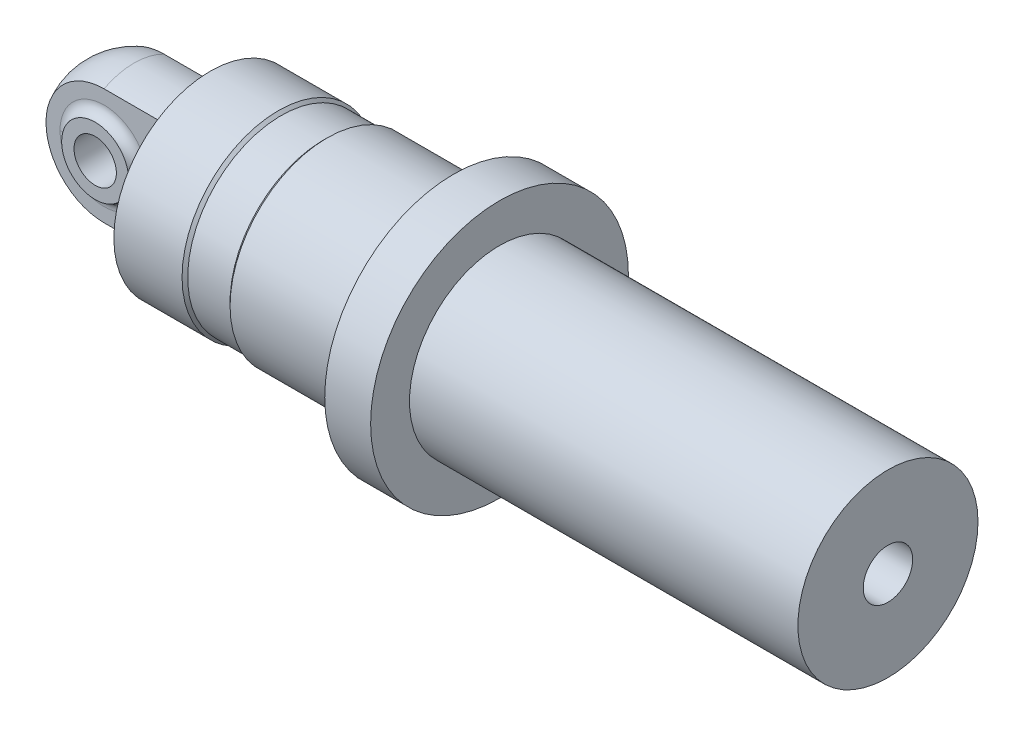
ISO-10303-21;
HEADER;
FILE_DESCRIPTION(('STEP AP214'),'2;1');
FILE_NAME('part.step','',(''),(''),'','','');
FILE_SCHEMA(('AUTOMOTIVE_DESIGN { 1 0 10303 214 1 1 1 1 }'));
ENDSEC;
DATA;
#1=APPLICATION_CONTEXT('core data for automotive mechanical design processes');
#2=APPLICATION_PROTOCOL_DEFINITION('international standard','automotive_design',2000,#1);
#3=PRODUCT_CONTEXT('',#1,'mechanical');
#4=PRODUCT('Part','Part','',(#3));
#5=PRODUCT_RELATED_PRODUCT_CATEGORY('part','',(#4));
#6=PRODUCT_DEFINITION_FORMATION('','',#4);
#7=PRODUCT_DEFINITION_CONTEXT('part definition',#1,'design');
#8=PRODUCT_DEFINITION('design','',#6,#7);
#9=PRODUCT_DEFINITION_SHAPE('','',#8);
#10=(LENGTH_UNIT() NAMED_UNIT(*) SI_UNIT(.MILLI.,.METRE.));
#11=(NAMED_UNIT(*) PLANE_ANGLE_UNIT() SI_UNIT($,.RADIAN.));
#12=(NAMED_UNIT(*) SI_UNIT($,.STERADIAN.) SOLID_ANGLE_UNIT());
#13=UNCERTAINTY_MEASURE_WITH_UNIT(LENGTH_MEASURE(1.E-05),#10,'distance_accuracy_value','');
#14=(GEOMETRIC_REPRESENTATION_CONTEXT(3) GLOBAL_UNCERTAINTY_ASSIGNED_CONTEXT((#13)) GLOBAL_UNIT_ASSIGNED_CONTEXT((#10,
#11,#12)) REPRESENTATION_CONTEXT('',''));
#15=CARTESIAN_POINT('',(0.,0.,0.));
#16=DIRECTION('',(0.,0.,1.));
#17=DIRECTION('',(1.,0.,0.));
#18=AXIS2_PLACEMENT_3D('',#15,#16,#17);
#19=CARTESIAN_POINT('',(0.,0.,-11.));
#20=DIRECTION('',(0.,0.,1.));
#21=DIRECTION('',(1.,0.,0.));
#22=AXIS2_PLACEMENT_3D('',#19,#20,#21);
#23=CYLINDRICAL_SURFACE('',#22,6.00000000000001);
#24=CARTESIAN_POINT('',(0.,0.,11.));
#25=DIRECTION('',(0.,0.,1.));
#26=DIRECTION('',(1.,0.,0.));
#27=AXIS2_PLACEMENT_3D('',#24,#25,#26);
#28=CIRCLE('',#27,6.00000000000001);
#29=CARTESIAN_POINT('',(6.00000000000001,0.,11.));
#30=VERTEX_POINT('',#29);
#31=EDGE_CURVE('E20',#30,#30,#28,.F.);
#32=ORIENTED_EDGE('',*,*,#31,.F.);
#33=EDGE_LOOP('',(#32));
#34=FACE_BOUND('',#33,.T.);
#35=CARTESIAN_POINT('',(0.,0.,-11.));
#36=DIRECTION('',(0.,0.,1.));
#37=DIRECTION('',(1.,0.,0.));
#38=AXIS2_PLACEMENT_3D('',#35,#36,#37);
#39=CIRCLE('',#38,6.00000000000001);
#40=CARTESIAN_POINT('',(6.00000000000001,0.,-11.));
#41=VERTEX_POINT('',#40);
#42=EDGE_CURVE('E82',#41,#41,#39,.T.);
#43=ORIENTED_EDGE('',*,*,#42,.F.);
#44=EDGE_LOOP('',(#43));
#45=FACE_BOUND('',#44,.T.);
#46=ADVANCED_FACE('F16',(#34,#45),#23,.F.);
#47=CARTESIAN_POINT('',(16.5,43.8,11.));
#48=DIRECTION('',(0.,0.,1.));
#49=DIRECTION('',(1.,0.,0.));
#50=AXIS2_PLACEMENT_3D('',#47,#48,#49);
#51=PLANE('',#50);
#52=CARTESIAN_POINT('',(0.,0.,11.));
#53=DIRECTION('',(0.,0.,1.));
#54=DIRECTION('',(1.,0.,0.));
#55=AXIS2_PLACEMENT_3D('',#52,#53,#54);
#56=CIRCLE('',#55,9.50000000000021);
#57=CARTESIAN_POINT('',(9.50000000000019,5.96898385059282E-09,11.));
#58=VERTEX_POINT('',#57);
#59=CARTESIAN_POINT('',(-9.50000000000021,-6.20844489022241E-08,11.));
#60=VERTEX_POINT('',#59);
#61=EDGE_CURVE('E72',#58,#60,#56,.T.);
#62=ORIENTED_EDGE('',*,*,#61,.T.);
#63=CARTESIAN_POINT('',(-9.5000000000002,-5.51861623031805E-08,11.));
#64=CARTESIAN_POINT('',(-9.50002350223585,-0.254403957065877,11.));
#65=CARTESIAN_POINT('',(-9.48978177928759,-0.508804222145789,11.));
#66=CARTESIAN_POINT('',(-9.44893882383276,-1.01594556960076,11.));
#67=CARTESIAN_POINT('',(-9.4183391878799,-1.26868678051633,11.));
#68=CARTESIAN_POINT('',(-9.33696262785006,-1.7708286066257,11.));
#69=CARTESIAN_POINT('',(-9.28619132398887,-2.02023013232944,11.));
#70=CARTESIAN_POINT('',(-9.16480570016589,-2.51416164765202,11.));
#71=CARTESIAN_POINT('',(-9.0941907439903,-2.75869148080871,11.));
#72=CARTESIAN_POINT('',(-8.92953388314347,-3.25342238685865,11.));
#73=CARTESIAN_POINT('',(-8.83449389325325,-3.50329192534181,11.));
#74=CARTESIAN_POINT('',(-8.62369838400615,-3.99414246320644,11.));
#75=CARTESIAN_POINT('',(-8.50794204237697,-4.2351231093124,11.));
#76=CARTESIAN_POINT('',(-8.25655410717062,-4.70644659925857,11.));
#77=CARTESIAN_POINT('',(-8.12092501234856,-4.93679077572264,11.));
#78=CARTESIAN_POINT('',(-7.83074696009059,-5.38523234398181,11.));
#79=CARTESIAN_POINT('',(-7.67619822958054,-5.60332988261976,11.));
#80=CARTESIAN_POINT('',(-7.34927684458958,-6.02573279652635,11.));
#81=CARTESIAN_POINT('',(-7.17690404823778,-6.23003806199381,11.));
#82=CARTESIAN_POINT('',(-6.81556481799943,-6.62339786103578,11.));
#83=CARTESIAN_POINT('',(-6.62659874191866,-6.81245272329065,11.));
#84=CARTESIAN_POINT('',(-6.23338531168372,-7.17399822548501,11.));
#85=CARTESIAN_POINT('',(-6.02913581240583,-7.34648653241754,11.));
#86=CARTESIAN_POINT('',(-5.60683137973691,-7.67364221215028,11.));
#87=CARTESIAN_POINT('',(-5.38877645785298,-7.82830959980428,11.));
#88=CARTESIAN_POINT('',(-4.94041933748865,-8.11871878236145,11.));
#89=CARTESIAN_POINT('',(-4.71011756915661,-8.25446124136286,11.));
#90=CARTESIAN_POINT('',(-4.23889710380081,-8.50606191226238,11.));
#91=CARTESIAN_POINT('',(-3.99797840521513,-8.6219201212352,11.));
#92=CARTESIAN_POINT('',(-3.50725138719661,-8.83292235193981,11.));
#93=CARTESIAN_POINT('',(-3.25744358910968,-8.92806758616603,11.));
#94=CARTESIAN_POINT('',(-2.75070093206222,-9.09697608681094,11.));
#95=CARTESIAN_POINT('',(-2.49376607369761,-9.17073935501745,11.));
#96=CARTESIAN_POINT('',(-1.97459110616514,-9.29636069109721,11.));
#97=CARTESIAN_POINT('',(-1.71235090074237,-9.34821836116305,11.));
#98=CARTESIAN_POINT('',(-1.18443408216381,-9.42965789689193,11.));
#99=CARTESIAN_POINT('',(-0.918757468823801,-9.45923976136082,11.));
#100=CARTESIAN_POINT('',(-0.385850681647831,-9.49591778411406,11.));
#101=CARTESIAN_POINT('',(-0.11862047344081,-9.50301344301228,11.));
#102=CARTESIAN_POINT('',(0.415487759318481,-9.49466720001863,11.));
#103=CARTESIAN_POINT('',(0.682365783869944,-9.47922529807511,11.));
#104=CARTESIAN_POINT('',(1.21387000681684,-9.42591394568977,11.));
#105=CARTESIAN_POINT('',(1.47849622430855,-9.38804468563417,11.));
#106=CARTESIAN_POINT('',(2.0036177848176,-9.29014800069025,11.));
#107=CARTESIAN_POINT('',(2.26411312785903,-9.23012057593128,11.));
#108=CARTESIAN_POINT('',(2.77911961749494,-9.08833469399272,11.));
#109=CARTESIAN_POINT('',(3.03363079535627,-9.00657635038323,11.));
#110=CARTESIAN_POINT('',(3.53486093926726,-8.82190974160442,11.));
#111=CARTESIAN_POINT('',(3.78157990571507,-8.71900147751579,11.));
#112=CARTESIAN_POINT('',(4.26547437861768,-8.49276535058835,11.));
#113=CARTESIAN_POINT('',(4.50264977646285,-8.36943725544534,11.));
#114=CARTESIAN_POINT('',(4.96577280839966,-8.10323629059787,11.));
#115=CARTESIAN_POINT('',(5.19172020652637,-7.96036301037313,11.));
#116=CARTESIAN_POINT('',(5.63076487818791,-7.65609678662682,11.));
#117=CARTESIAN_POINT('',(5.84386276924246,-7.49470473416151,11.));
#118=CARTESIAN_POINT('',(6.25570494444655,-7.15454306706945,11.));
#119=CARTESIAN_POINT('',(6.45444925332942,-6.97577348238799,11.));
#120=CARTESIAN_POINT('',(6.83614948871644,-6.60214922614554,11.));
#121=CARTESIAN_POINT('',(7.01910725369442,-6.40729643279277,11.));
#122=CARTESIAN_POINT('',(7.36796001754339,-6.00287259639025,11.));
#123=CARTESIAN_POINT('',(7.53385501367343,-5.79330155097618,11.));
#124=CARTESIAN_POINT('',(7.84744819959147,-5.36086858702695,11.));
#125=CARTESIAN_POINT('',(7.99514114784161,-5.13800286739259,11.));
#126=CARTESIAN_POINT('',(8.27122042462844,-4.68062642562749,11.));
#127=CARTESIAN_POINT('',(8.39960729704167,-4.4461160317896,11.));
#128=CARTESIAN_POINT('',(8.63623449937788,-3.96697461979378,11.));
#129=CARTESIAN_POINT('',(8.74446319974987,-3.72233785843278,11.));
#130=CARTESIAN_POINT('',(8.93990981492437,-3.22481631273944,11.));
#131=CARTESIAN_POINT('',(9.02712826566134,-2.97193173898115,11.));
#132=CARTESIAN_POINT('',(9.17985020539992,-2.46000484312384,11.));
#133=CARTESIAN_POINT('',(9.24537809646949,-2.20096979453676,11.));
#134=CARTESIAN_POINT('',(9.35436588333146,-1.67840179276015,11.));
#135=CARTESIAN_POINT('',(9.39783581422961,-1.41487094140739,11.));
#136=CARTESIAN_POINT('',(9.4534179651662,-0.959107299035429,11.));
#137=CARTESIAN_POINT('',(9.47089671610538,-0.767511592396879,11.));
#138=CARTESIAN_POINT('',(9.49418007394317,-0.383949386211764,11.));
#139=CARTESIAN_POINT('',(9.50000509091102,-0.191984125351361,11.));
#140=CARTESIAN_POINT('',(9.5000000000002,1.19379711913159E-08,11.));
#141=B_SPLINE_CURVE_WITH_KNOTS('',3,(#63,#64,#65,#66,#67,#68,#69,#70,#71,#72,#73,#74,#75,#76,
#77,#78,#79,#80,#81,#82,#83,#84,#85,#86,#87,#88,#89,#90,#91,#92,#93,#94,#95,#96,#97,#98,#99,
#100,#101,#102,#103,#104,#105,#106,#107,#108,#109,#110,#111,#112,#113,#114,#115,#116,#117,#118,
#119,#120,#121,#122,#123,#124,#125,#126,#127,#128,#129,#130,#131,#132,#133,#134,#135,#136,#137,
#138,#139,#140),.UNSPECIFIED.,.F.,.F.,(4,2,2,2,2,2,2,2,2,2,2,2,2,2,2,2,2,2,2,2,2,2,2,2,2,2,2,2,
2,2,2,2,2,2,2,2,2,2,4),(0.,0.763000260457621,1.52594069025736,2.28866869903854,3.05142116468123,
3.85246403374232,4.65353870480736,5.45451273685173,6.25547716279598,7.05644796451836,
7.85740149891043,8.65846766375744,9.45953316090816,10.2605705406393,11.0616080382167,
11.8625986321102,12.66358915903,13.4645942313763,14.2655993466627,15.0666222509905,
15.8676451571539,16.6686612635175,17.4696773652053,18.2706892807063,19.0717011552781,
19.8727221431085,20.6737599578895,21.4747592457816,22.2757571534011,23.0766616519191,
23.8775662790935,24.6787010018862,25.4798131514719,26.281386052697,27.0829385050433,
27.8835861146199,28.6838691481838,29.2607070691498,29.8365338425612),.UNSPECIFIED.);
#142=EDGE_CURVE('E75',#60,#58,#141,.T.);
#143=ORIENTED_EDGE('',*,*,#142,.T.);
#144=EDGE_LOOP('',(#62,#143));
#145=FACE_BOUND('',#144,.T.);
#146=ORIENTED_EDGE('',*,*,#31,.T.);
#147=EDGE_LOOP('',(#146));
#148=FACE_BOUND('',#147,.T.);
#149=ADVANCED_FACE('F77',(#145,#148),#51,.T.);
#150=CARTESIAN_POINT('',(-28.5010000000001,43.8,-11.));
#151=DIRECTION('',(0.,0.,-1.));
#152=DIRECTION('',(-1.,0.,0.));
#153=AXIS2_PLACEMENT_3D('',#150,#151,#152);
#154=PLANE('',#153);
#155=CARTESIAN_POINT('',(0.,0.,-11.));
#156=DIRECTION('',(0.,0.,-1.));
#157=DIRECTION('',(0.,1.,0.));
#158=AXIS2_PLACEMENT_3D('',#155,#156,#157);
#159=CIRCLE('',#158,9.50000000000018);
#160=CARTESIAN_POINT('',(0.,9.50000000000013,-11.));
#161=VERTEX_POINT('',#160);
#162=EDGE_CURVE('E97',#161,#161,#159,.T.);
#163=ORIENTED_EDGE('',*,*,#162,.T.);
#164=EDGE_LOOP('',(#163));
#165=FACE_BOUND('',#164,.T.);
#166=ORIENTED_EDGE('',*,*,#42,.T.);
#167=EDGE_LOOP('',(#166));
#168=FACE_BOUND('',#167,.T.);
#169=ADVANCED_FACE('F114',(#165,#168),#154,.T.);
#170=CARTESIAN_POINT('',(-12.4580272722,1.19233223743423E-13,8.50000000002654));
#171=CARTESIAN_POINT('',(-12.4580272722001,-7.29774343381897,8.50000000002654));
#172=CARTESIAN_POINT('',(-7.29774339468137,-12.4580272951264,8.50000000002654));
#173=CARTESIAN_POINT('',(3.91377208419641E-08,-12.4580272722,8.50000000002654));
#174=CARTESIAN_POINT('',(7.29774347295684,-12.4580272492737,8.50000000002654));
#175=CARTESIAN_POINT('',(12.4580273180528,-7.29774335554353,8.50000000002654));
#176=CARTESIAN_POINT('',(12.4580272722,7.82755527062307E-08,8.50000000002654));
#177=CARTESIAN_POINT('',(-10.9257104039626,1.04567733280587E-13,8.50000644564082));
#178=CARTESIAN_POINT('',(-10.9257104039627,-6.40013299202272,8.50000644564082));
#179=CARTESIAN_POINT('',(-6.40013295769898,-10.9257104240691,8.50000644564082));
#180=CARTESIAN_POINT('',(3.43238493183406E-08,-10.9257104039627,8.50000644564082));
#181=CARTESIAN_POINT('',(6.4001330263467,-10.9257103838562,8.50000644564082));
#182=CARTESIAN_POINT('',(10.9257104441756,-6.40013292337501,8.50000644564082));
#183=CARTESIAN_POINT('',(10.9257104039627,6.86478096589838E-08,8.50000644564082));
#184=CARTESIAN_POINT('',(-9.75538614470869,0.,9.48911519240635));
#185=CARTESIAN_POINT('',(-9.75538614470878,-5.71457291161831,9.48911519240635));
#186=CARTESIAN_POINT('',(-5.71457288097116,-9.75538616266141,9.48911519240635));
#187=CARTESIAN_POINT('',(3.06472069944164E-08,-9.75538614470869,9.48911519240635));
#188=CARTESIAN_POINT('',(5.71457294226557,-9.75538612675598,9.48911519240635));
#189=CARTESIAN_POINT('',(9.75538618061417,-5.7145728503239,9.48911519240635));
#190=CARTESIAN_POINT('',(9.75538614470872,6.12944972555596E-08,9.48911519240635));
#191=CARTESIAN_POINT('',(-9.5000000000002,0.,11.));
#192=CARTESIAN_POINT('',(-9.50000000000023,-5.56497117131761,11.));
#193=CARTESIAN_POINT('',(-5.56497114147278,-9.50000001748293,11.));
#194=CARTESIAN_POINT('',(2.98448488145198E-08,-9.5000000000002,11.));
#195=CARTESIAN_POINT('',(5.56497120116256,-9.49999998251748,11.));
#196=CARTESIAN_POINT('',(9.50000003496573,-5.56497111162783,11.));
#197=CARTESIAN_POINT('',(9.5000000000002,5.96898641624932E-08,11.));
#198=CARTESIAN_POINT('',(-9.49996666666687,0.,11.0001972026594));
#199=CARTESIAN_POINT('',(-9.4999666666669,-5.56495164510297,11.0001972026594));
#200=CARTESIAN_POINT('',(-5.56495161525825,-9.49996668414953,11.0001972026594));
#201=CARTESIAN_POINT('',(2.98447440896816E-08,-9.49996666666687,11.0001972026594));
#202=CARTESIAN_POINT('',(5.56495167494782,-9.49996664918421,11.0001972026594));
#203=CARTESIAN_POINT('',(9.49996670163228,-5.5649515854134,11.0001972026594));
#204=CARTESIAN_POINT('',(9.49996666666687,5.96896547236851E-08,11.0001972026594));
#205=CARTESIAN_POINT('',(-9.49993333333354,0.,11.0003944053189));
#206=CARTESIAN_POINT('',(-9.49993333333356,-5.56493211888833,11.0003944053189));
#207=CARTESIAN_POINT('',(-5.56493208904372,-9.49993335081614,11.0003944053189));
#208=CARTESIAN_POINT('',(2.98446393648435E-08,-9.49993333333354,11.0003944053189));
#209=CARTESIAN_POINT('',(5.56493214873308,-9.49993331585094,11.0003944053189));
#210=CARTESIAN_POINT('',(9.49993336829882,-5.56493205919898,11.0003944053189));
#211=CARTESIAN_POINT('',(9.49993333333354,5.96894452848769E-08,11.0003944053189));
#212=CARTESIAN_POINT('',(-9.4999000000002,0.,11.0005916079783));
#213=CARTESIAN_POINT('',(-9.49990000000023,-5.5649125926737,11.0005916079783));
#214=CARTESIAN_POINT('',(-5.56491256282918,-9.49990001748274,11.0005916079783));
#215=CARTESIAN_POINT('',(2.98445346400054E-08,-9.4999000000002,11.0005916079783));
#216=CARTESIAN_POINT('',(5.56491262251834,-9.49989998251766,11.0005916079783));
#217=CARTESIAN_POINT('',(9.49990003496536,-5.56491253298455,11.0005916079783));
#218=CARTESIAN_POINT('',(9.4999000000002,5.96892358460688E-08,11.0005916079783));
#219=(BOUNDED_SURFACE() B_SPLINE_SURFACE(3,3,((#170,#171,#172,#173,#174,#175,#176),(#177,#178,
#179,#180,#181,#182,#183),(#184,#185,#186,#187,#188,#189,#190),(#191,#192,#193,#194,#195,#196,
#197),(#198,#199,#200,#201,#202,#203,#204),(#205,#206,#207,#208,#209,#210,#211),(#212,#213,#214,
#215,#216,#217,#218)),.UNSPECIFIED.,.F.,.F.,.F.) B_SPLINE_SURFACE_WITH_KNOTS((4,3,4),(4,3,4),
(0.,1.,1.00015491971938),(0.,0.5,1.),
.UNSPECIFIED.) GEOMETRIC_REPRESENTATION_ITEM() RATIONAL_B_SPLINE_SURFACE(((1.,0.804737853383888,
0.804737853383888,1.,0.804737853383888,0.804737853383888,1.),(0.842509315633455,
0.677999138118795,0.677999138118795,0.842509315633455,0.677999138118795,0.677999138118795,
0.842509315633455),(0.842509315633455,0.677999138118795,0.677999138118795,0.842509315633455,
0.677999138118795,0.677999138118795,0.842509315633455),(1.,0.804737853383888,0.804737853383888,
1.,0.804737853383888,0.804737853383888,1.),(1.,0.804737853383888,0.804737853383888,1.,
0.804737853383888,0.804737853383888,1.),(1.,0.804737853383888,0.804737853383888,1.,
0.804737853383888,0.804737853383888,1.),(1.,0.804737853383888,0.804737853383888,1.,
0.804737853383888,0.804737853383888,1.))) REPRESENTATION_ITEM('') SURFACE());
#220=CARTESIAN_POINT('',(-12.4580272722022,1.19233223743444E-13,8.50000000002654));
#221=CARTESIAN_POINT('',(-12.4580302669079,-0.185188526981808,8.50000000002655));
#222=CARTESIAN_POINT('',(-12.4538981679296,-0.370377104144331,8.50000000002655));
#223=CARTESIAN_POINT('',(-12.437239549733,-0.743645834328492,8.50000000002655));
#224=CARTESIAN_POINT('',(-12.4245664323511,-0.931719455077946,8.50000000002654));
#225=CARTESIAN_POINT('',(-12.3904173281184,-1.31023619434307,8.50000000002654));
#226=CARTESIAN_POINT('',(-12.3687977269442,-1.50066636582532,8.50000000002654));
#227=CARTESIAN_POINT('',(-12.3163884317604,-1.88332054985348,8.50000000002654));
#228=CARTESIAN_POINT('',(-12.2854595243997,-2.075525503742,8.50000000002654));
#229=CARTESIAN_POINT('',(-12.2141076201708,-2.46110232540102,8.50000000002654));
#230=CARTESIAN_POINT('',(-12.1735511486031,-2.65444950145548,8.50000000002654));
#231=CARTESIAN_POINT('',(-12.082672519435,-3.04163641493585,8.50000000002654));
#232=CARTESIAN_POINT('',(-12.0322239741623,-3.23544649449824,8.50000000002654));
#233=CARTESIAN_POINT('',(-11.9213488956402,-3.6228424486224,8.50000000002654));
#234=CARTESIAN_POINT('',(-11.8608043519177,-3.81639455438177,8.50000000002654));
#235=CARTESIAN_POINT('',(-11.7295911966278,-4.20252166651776,8.50000000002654));
#236=CARTESIAN_POINT('',(-11.6588141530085,-4.39505983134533,8.50000000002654));
#237=CARTESIAN_POINT('',(-11.5070621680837,-4.77837751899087,8.50000000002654));
#238=CARTESIAN_POINT('',(-11.4259894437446,-4.96911833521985,8.50000000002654));
#239=CARTESIAN_POINT('',(-11.2536496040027,-5.34803971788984,8.50000000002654));
#240=CARTESIAN_POINT('',(-11.1622962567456,-5.53618106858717,8.50000000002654));
#241=CARTESIAN_POINT('',(-10.9694798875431,-5.90909138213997,8.50000000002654));
#242=CARTESIAN_POINT('',(-10.867942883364,-6.09382209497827,8.50000000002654));
#243=CARTESIAN_POINT('',(-10.6549276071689,-6.45909875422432,8.50000000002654));
#244=CARTESIAN_POINT('',(-10.5433880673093,-6.63960897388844,8.50000000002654));
#245=CARTESIAN_POINT('',(-10.3106207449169,-6.99564283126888,8.50000000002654));
#246=CARTESIAN_POINT('',(-10.189344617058,-7.1711348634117,8.50000000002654));
#247=CARTESIAN_POINT('',(-9.93744102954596,-7.51635213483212,8.50000000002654));
#248=CARTESIAN_POINT('',(-9.8067780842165,-7.686051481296,8.50000000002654));
#249=CARTESIAN_POINT('',(-9.53651921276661,-8.01893575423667,8.50000000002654));
#250=CARTESIAN_POINT('',(-9.39690032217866,-8.18210203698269,8.50000000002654));
#251=CARTESIAN_POINT('',(-9.10922520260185,-8.50121574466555,8.50000000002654));
#252=CARTESIAN_POINT('',(-8.96115792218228,-8.65715320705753,8.50000000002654));
#253=CARTESIAN_POINT('',(-8.65715317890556,-8.9611579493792,8.50000000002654));
#254=CARTESIAN_POINT('',(-8.50121571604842,-9.1092252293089,8.50000000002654));
#255=CARTESIAN_POINT('',(-8.18210200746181,-9.39690034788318,8.50000000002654));
#256=CARTESIAN_POINT('',(-8.01893572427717,-9.5365192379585,8.50000000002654));
#257=CARTESIAN_POINT('',(-7.68605145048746,-9.80677810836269,8.50000000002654));
#258=CARTESIAN_POINT('',(-7.5163521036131,-9.93744105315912,8.50000000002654));
#259=CARTESIAN_POINT('',(-7.1711348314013,-10.1893446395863,8.50000000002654));
#260=CARTESIAN_POINT('',(-6.9956427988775,-10.3106207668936,8.50000000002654));
#261=CARTESIAN_POINT('',(-6.63960894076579,-10.5433880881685,8.50000000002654));
#262=CARTESIAN_POINT('',(-6.45909872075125,-10.6549276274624,8.50000000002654));
#263=CARTESIAN_POINT('',(-6.09382206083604,-10.8679429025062,8.50000000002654));
#264=CARTESIAN_POINT('',(-5.90909134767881,-10.9694799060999,8.50000000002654));
#265=CARTESIAN_POINT('',(-5.53618103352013,-11.1622962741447,8.50000000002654));
#266=CARTESIAN_POINT('',(-5.34803968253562,-11.2536496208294,8.50000000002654));
#267=CARTESIAN_POINT('',(-4.9691182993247,-11.42598945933,8.50000000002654));
#268=CARTESIAN_POINT('',(-4.7783774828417,-11.5070621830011,8.50000000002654));
#269=CARTESIAN_POINT('',(-4.3950597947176,-11.658814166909,8.50000000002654));
#270=CARTESIAN_POINT('',(-4.20252162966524,-11.7295912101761,8.50000000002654));
#271=CARTESIAN_POINT('',(-3.81639451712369,-11.8608043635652,8.50000000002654));
#272=CARTESIAN_POINT('',(-3.6228424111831,-11.9213489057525,8.50000000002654));
#273=CARTESIAN_POINT('',(-3.23544645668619,-12.0322239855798,8.50000000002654));
#274=CARTESIAN_POINT('',(-3.04163637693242,-12.0826725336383,8.50000000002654));
#275=CARTESIAN_POINT('',(-2.65444946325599,-12.1735511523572,8.50000000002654));
#276=CARTESIAN_POINT('',(-2.46110228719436,-12.2141076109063,8.50000000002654));
#277=CARTESIAN_POINT('',(-2.07552546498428,-12.2854595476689,8.50000000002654));
#278=CARTESIAN_POINT('',(-1.88332051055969,-12.3163884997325,8.50000000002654));
#279=CARTESIAN_POINT('',(-1.50066632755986,-12.3687976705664,8.50000000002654));
#280=CARTESIAN_POINT('',(-1.31023615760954,-12.390417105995,8.50000000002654));
#281=CARTESIAN_POINT('',(-0.931719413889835,-12.4245666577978,8.50000000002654));
#282=CARTESIAN_POINT('',(-0.743645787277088,-12.437240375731,8.50000000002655));
#283=CARTESIAN_POINT('',(-0.37037707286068,-12.4538973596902,8.50000000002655));
#284=CARTESIAN_POINT('',(-0.185188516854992,-12.458027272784,8.50000000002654));
#285=CARTESIAN_POINT('',(0.185188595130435,-12.4580272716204,8.50000000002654));
#286=CARTESIAN_POINT('',(0.370377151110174,-12.453897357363,8.50000000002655));
#287=CARTESIAN_POINT('',(0.743645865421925,-12.4372403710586,8.50000000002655));
#288=CARTESIAN_POINT('',(0.931719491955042,-12.4245666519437,8.50000000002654));
#289=CARTESIAN_POINT('',(1.31023623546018,-12.3904170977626,8.50000000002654));
#290=CARTESIAN_POINT('',(1.50066640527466,-12.3687976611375,8.50000000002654));
#291=CARTESIAN_POINT('',(1.8833205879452,-12.3163884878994,8.50000000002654));
#292=CARTESIAN_POINT('',(2.07552554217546,-12.2854595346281,8.50000000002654));
#293=CARTESIAN_POINT('',(2.46110236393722,-12.2141075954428,8.50000000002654));
#294=CARTESIAN_POINT('',(2.65444953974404,-12.1735511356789,8.50000000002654));
#295=CARTESIAN_POINT('',(3.04163645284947,-12.0826725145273,8.50000000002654));
#296=CARTESIAN_POINT('',(3.23544653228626,-12.032223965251,8.50000000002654));
#297=CARTESIAN_POINT('',(3.62284248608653,-11.9213488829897,8.50000000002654));
#298=CARTESIAN_POINT('',(3.81639459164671,-11.8608043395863,8.50000000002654));
#299=CARTESIAN_POINT('',(4.20252170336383,-11.7295911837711,8.50000000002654));
#300=CARTESIAN_POINT('',(4.39505986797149,-11.6588141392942,8.50000000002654));
#301=CARTESIAN_POINT('',(4.77837755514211,-11.5070621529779,8.50000000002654));
#302=CARTESIAN_POINT('',(4.96911837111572,-11.4259894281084,8.50000000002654));
#303=CARTESIAN_POINT('',(5.34803975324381,-11.253649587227,8.50000000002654));
#304=CARTESIAN_POINT('',(5.53618110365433,-11.1622962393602,8.50000000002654));
#305=CARTESIAN_POINT('',(5.90909141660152,-10.9694798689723,8.50000000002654));
#306=CARTESIAN_POINT('',(6.09382212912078,-10.8679428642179,8.50000000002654));
#307=CARTESIAN_POINT('',(6.45909878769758,-10.654927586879,8.50000000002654));
#308=CARTESIAN_POINT('',(6.63960900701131,-10.543388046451,8.50000000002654));
#309=CARTESIAN_POINT('',(6.99564286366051,-10.310620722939,8.50000000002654));
#310=CARTESIAN_POINT('',(7.17113489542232,-10.1893445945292,8.50000000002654));
#311=CARTESIAN_POINT('',(7.51635216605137,-9.93744100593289,8.50000000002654));
#312=CARTESIAN_POINT('',(7.68605151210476,-9.8067780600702,8.50000000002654));
#313=CARTESIAN_POINT('',(8.01893578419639,-9.53651918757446,8.50000000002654));
#314=CARTESIAN_POINT('',(8.18210206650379,-9.39690029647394,8.50000000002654));
#315=CARTESIAN_POINT('',(8.5012157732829,-9.10922517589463,8.50000000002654));
#316=CARTESIAN_POINT('',(8.65715323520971,-8.96115789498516,8.50000000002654));
#317=CARTESIAN_POINT('',(8.96115797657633,-8.65715315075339,8.50000000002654));
#318=CARTESIAN_POINT('',(9.10922525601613,-8.50121568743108,8.50000000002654));
#319=CARTESIAN_POINT('',(9.3969003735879,-8.18210197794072,8.50000000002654));
#320=CARTESIAN_POINT('',(9.53651926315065,-8.01893569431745,8.50000000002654));
#321=CARTESIAN_POINT('',(9.80677813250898,-7.68605141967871,8.50000000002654));
#322=CARTESIAN_POINT('',(9.9374410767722,-7.51635207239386,8.50000000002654));
#323=CARTESIAN_POINT('',(10.1893446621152,-7.17113479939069,8.50000000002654));
#324=CARTESIAN_POINT('',(10.3106207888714,-6.99564276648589,8.50000000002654));
#325=CARTESIAN_POINT('',(10.5433881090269,-6.63960890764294,8.50000000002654));
#326=CARTESIAN_POINT('',(10.6549276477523,-6.45909868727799,8.50000000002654));
#327=CARTESIAN_POINT('',(10.8679429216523,-6.09382202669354,8.50000000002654));
#328=CARTESIAN_POINT('',(10.9694799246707,-5.90909131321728,8.50000000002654));
#329=CARTESIAN_POINT('',(11.1622962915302,-5.53618099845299,8.50000000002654));
#330=CARTESIAN_POINT('',(11.2536496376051,-5.34803964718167,8.50000000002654));
#331=CARTESIAN_POINT('',(11.4259894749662,-4.96911826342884,8.50000000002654));
#332=CARTESIAN_POINT('',(11.5070621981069,-4.77837744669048,8.50000000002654));
#333=CARTESIAN_POINT('',(11.6588141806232,-4.39505975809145,8.50000000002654));
#334=CARTESIAN_POINT('',(11.7295912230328,-4.20252159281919,8.50000000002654));
#335=CARTESIAN_POINT('',(11.8608043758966,-3.81639447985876,8.50000000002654));
#336=CARTESIAN_POINT('',(11.921348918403,-3.62284237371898,8.50000000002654));
#337=CARTESIAN_POINT('',(12.032223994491,-3.23544641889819,8.50000000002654));
#338=CARTESIAN_POINT('',(12.082672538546,-3.04163633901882,8.50000000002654));
#339=CARTESIAN_POINT('',(12.1735511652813,-2.65444942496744,8.50000000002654));
#340=CARTESIAN_POINT('',(12.2141076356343,-2.46110224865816,8.50000000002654));
#341=CARTESIAN_POINT('',(12.2854595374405,-2.07552542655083,8.50000000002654));
#342=CARTESIAN_POINT('',(12.3163884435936,-1.88332047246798,8.50000000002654));
#343=CARTESIAN_POINT('',(12.3687977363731,-1.50066628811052,8.50000000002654));
#344=CARTESIAN_POINT('',(12.3904173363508,-1.31023611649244,8.50000000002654));
#345=CARTESIAN_POINT('',(12.4245664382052,-0.931719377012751,8.50000000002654));
#346=CARTESIAN_POINT('',(12.4372395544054,-0.743645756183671,8.50000000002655));
#347=CARTESIAN_POINT('',(12.4538981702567,-0.370377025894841,8.50000000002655));
#348=CARTESIAN_POINT('',(12.4580302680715,-0.185188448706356,8.50000000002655));
#349=CARTESIAN_POINT('',(12.4580272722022,7.82755527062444E-08,8.50000000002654));
#350=B_SPLINE_CURVE_WITH_KNOTS('',3,(#220,#221,#222,#223,#224,#225,#226,#227,#228,#229,#230,
#231,#232,#233,#234,#235,#236,#237,#238,#239,#240,#241,#242,#243,#244,#245,#246,#247,#248,#249,
#250,#251,#252,#253,#254,#255,#256,#257,#258,#259,#260,#261,#262,#263,#264,#265,#266,#267,#268,
#269,#270,#271,#272,#273,#274,#275,#276,#277,#278,#279,#280,#281,#282,#283,#284,#285,#286,#287,
#288,#289,#290,#291,#292,#293,#294,#295,#296,#297,#298,#299,#300,#301,#302,#303,#304,#305,#306,
#307,#308,#309,#310,#311,#312,#313,#314,#315,#316,#317,#318,#319,#320,#321,#322,#323,#324,#325,
#326,#327,#328,#329,#330,#331,#332,#333,#334,#335,#336,#337,#338,#339,#340,#341,#342,#343,#344,
#345,#346,#347,#348,#349),.UNSPECIFIED.,.F.,.F.,(4,2,2,2,2,2,2,2,2,2,2,2,2,2,2,2,2,2,2,2,2,2,2,
2,2,2,2,2,2,2,2,2,2,2,2,2,2,2,2,2,2,2,2,2,2,2,2,2,2,2,2,2,2,2,2,2,2,2,2,2,2,2,2,2,4),(0.,
0.555519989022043,1.12082631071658,1.69558274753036,2.27940157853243,2.87184302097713,
3.47241527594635,4.08057523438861,4.69572988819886,5.31723847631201,5.94441537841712,
6.5765337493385,7.21282986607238,7.85250813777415,8.49474670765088,9.13870355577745,
9.78352299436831,10.4283424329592,11.0722992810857,11.7145378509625,12.3542161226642,
12.9905122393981,13.6226306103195,14.2498075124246,14.8713161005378,15.486470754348,
16.0946307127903,16.6952029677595,17.2876444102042,17.8714632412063,18.44621967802,
19.0115259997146,19.5670459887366,20.1225659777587,20.6878722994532,21.262628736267,
21.8464475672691,22.4388890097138,23.039461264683,23.6476212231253,24.2627758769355,
24.8842844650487,25.5114613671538,26.1435797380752,26.779875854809,27.4195541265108,
28.0617926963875,28.7057495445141,29.350568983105,29.9953884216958,30.6393452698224,
31.2815838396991,31.9212621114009,32.5575582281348,33.1896765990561,33.8168535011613,
34.4383620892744,35.0535167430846,35.6616767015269,36.2622489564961,36.8546903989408,
37.4385092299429,38.0132656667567,38.5785719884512,39.1340919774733),.UNSPECIFIED.);
#351=CARTESIAN_POINT('',(-12.4580272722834,-3.61847176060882E-08,8.50000000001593));
#352=VERTEX_POINT('',#351);
#353=CARTESIAN_POINT('',(12.4580272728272,2.81791821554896E-08,8.50000000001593));
#354=VERTEX_POINT('',#353);
#355=EDGE_CURVE('E88',#352,#354,#350,.T.);
#356=CARTESIAN_POINT('',(12.45803989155,0.,11.5000000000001));
#357=DIRECTION('',(0.,1.,0.));
#358=DIRECTION('',(-1.,0.,0.));
#359=AXIS2_PLACEMENT_3D('',#356,#357,#358);
#360=CIRCLE('',#359,3.00000000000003);
#361=EDGE_CURVE('E81',#354,#58,#360,.T.);
#362=CARTESIAN_POINT('',(-12.45803989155,-9.04620911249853E-08,11.5));
#363=DIRECTION('',(-7.26134596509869E-09,1.,0.));
#364=DIRECTION('',(-1.,-7.26134596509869E-09,0.));
#365=AXIS2_PLACEMENT_3D('',#362,#363,#364);
#366=CIRCLE('',#365,3.);
#367=EDGE_CURVE('E95',#60,#352,#366,.T.);
#368=ORIENTED_EDGE('',*,*,#355,.T.);
#369=ORIENTED_EDGE('',*,*,#361,.T.);
#370=ORIENTED_EDGE('',*,*,#142,.F.);
#371=ORIENTED_EDGE('',*,*,#367,.T.);
#372=EDGE_LOOP('',(#368,#369,#370,#371));
#373=FACE_BOUND('',#372,.T.);
#374=ADVANCED_FACE('F86',(#373),#219,.F.);
#375=CARTESIAN_POINT('',(0.,0.,11.5000000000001));
#376=DIRECTION('',(0.,0.,1.));
#377=DIRECTION('',(1.,0.,0.));
#378=AXIS2_PLACEMENT_3D('',#375,#376,#377);
#379=TOROIDAL_SURFACE('',#378,12.45803989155,3.00000000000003);
#380=ORIENTED_EDGE('',*,*,#367,.F.);
#381=ORIENTED_EDGE('',*,*,#61,.F.);
#382=ORIENTED_EDGE('',*,*,#361,.F.);
#383=CARTESIAN_POINT('',(12.4580272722,0.,8.50000000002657));
#384=CARTESIAN_POINT('',(12.4580211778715,0.112326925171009,8.50000000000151));
#385=CARTESIAN_POINT('',(12.4565090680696,0.224654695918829,8.49999999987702));
#386=CARTESIAN_POINT('',(12.450470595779,0.449229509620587,8.50000000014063));
#387=CARTESIAN_POINT('',(12.4459442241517,0.561476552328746,8.50000000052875));
#388=CARTESIAN_POINT('',(12.4338749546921,0.785807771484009,8.5000000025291));
#389=CARTESIAN_POINT('',(12.4263320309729,0.897891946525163,8.50000000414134));
#390=CARTESIAN_POINT('',(12.4064532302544,1.14421865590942,8.50000001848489));
#391=CARTESIAN_POINT('',(12.3934604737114,1.2784094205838,8.50000003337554));
#392=CARTESIAN_POINT('',(12.3726685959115,1.46160088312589,8.50000005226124));
#393=CARTESIAN_POINT('',(12.3667791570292,1.51082433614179,8.5000000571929));
#394=CARTESIAN_POINT('',(12.3495362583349,1.64775583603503,8.50000006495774));
#395=CARTESIAN_POINT('',(12.3375188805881,1.73538138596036,8.50000006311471));
#396=CARTESIAN_POINT('',(12.3072996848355,1.93944875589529,8.50000005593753));
#397=CARTESIAN_POINT('',(12.2883702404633,2.0557827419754,8.5000000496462));
#398=CARTESIAN_POINT('',(12.2420631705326,2.31682659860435,8.5000000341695));
#399=CARTESIAN_POINT('',(12.2137561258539,2.46137326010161,8.50000002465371));
#400=CARTESIAN_POINT('',(12.1688158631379,2.67101331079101,8.50000001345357));
#401=CARTESIAN_POINT('',(12.1542103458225,2.73654788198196,8.50000001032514));
#402=CARTESIAN_POINT('',(12.1274170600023,2.85236244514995,8.50000000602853));
#403=CARTESIAN_POINT('',(12.1154435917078,2.90269199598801,8.50000000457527));
#404=CARTESIAN_POINT('',(12.0805106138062,3.04560261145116,8.50000000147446));
#405=CARTESIAN_POINT('',(12.0568058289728,3.13800253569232,8.50000000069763));
#406=CARTESIAN_POINT('',(12.0043169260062,3.33329715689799,8.49999999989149));
#407=CARTESIAN_POINT('',(11.9752646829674,3.43611978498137,8.49999999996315));
#408=CARTESIAN_POINT('',(11.9112785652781,3.65196844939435,8.5000000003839));
#409=CARTESIAN_POINT('',(11.8760480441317,3.76490664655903,8.50000000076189));
#410=CARTESIAN_POINT('',(11.7988268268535,4.0006215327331,8.50000000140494));
#411=CARTESIAN_POINT('',(11.7565118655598,4.123292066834,8.50000000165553));
#412=CARTESIAN_POINT('',(11.6641743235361,4.37802317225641,8.50000000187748));
#413=CARTESIAN_POINT('',(11.6138010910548,4.50995674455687,8.50000000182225));
#414=CARTESIAN_POINT('',(11.5043388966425,4.78266790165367,8.50000000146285));
#415=CARTESIAN_POINT('',(11.4448743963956,4.92329479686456,8.50000000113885));
#416=CARTESIAN_POINT('',(11.3161674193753,5.21274012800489,8.50000000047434));
#417=CARTESIAN_POINT('',(11.2465260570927,5.3613815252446,8.50000000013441));
#418=CARTESIAN_POINT('',(11.1122988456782,5.63375191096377,8.49999999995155));
#419=CARTESIAN_POINT('',(11.0485172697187,5.7578787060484,8.50000000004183));
#420=CARTESIAN_POINT('',(10.8931866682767,6.0480685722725,8.50000000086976));
#421=CARTESIAN_POINT('',(10.7998855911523,6.21319905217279,8.50000000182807));
#422=CARTESIAN_POINT('',(10.6222552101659,6.5114532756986,8.50000000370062));
#423=CARTESIAN_POINT('',(10.5390781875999,6.64526591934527,8.5000000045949));
#424=CARTESIAN_POINT('',(10.3679398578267,6.90927486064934,8.50000000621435));
#425=CARTESIAN_POINT('',(10.2799923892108,7.03948012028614,8.50000000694));
#426=CARTESIAN_POINT('',(10.0994818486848,7.29611134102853,8.50000000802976));
#427=CARTESIAN_POINT('',(10.0069322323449,7.42254676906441,8.50000000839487));
#428=CARTESIAN_POINT('',(9.81738927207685,7.67148719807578,8.50000000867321));
#429=CARTESIAN_POINT('',(9.72040898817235,7.79400214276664,8.5000000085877));
#430=CARTESIAN_POINT('',(9.5221815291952,8.03495817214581,8.50000000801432));
#431=CARTESIAN_POINT('',(9.42094700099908,8.15340966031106,8.50000000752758));
#432=CARTESIAN_POINT('',(9.21439097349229,8.38610065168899,8.50000000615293));
#433=CARTESIAN_POINT('',(9.10908169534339,8.50035100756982,8.50000000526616));
#434=CARTESIAN_POINT('',(8.88128455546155,8.73839656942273,8.50000000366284));
#435=CARTESIAN_POINT('',(8.75825838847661,8.86167730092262,8.50000000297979));
#436=CARTESIAN_POINT('',(8.50715440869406,9.10297924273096,8.50000000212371));
#437=CARTESIAN_POINT('',(8.37907660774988,9.22100046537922,8.50000000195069));
#438=CARTESIAN_POINT('',(8.11809042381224,9.45157640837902,8.50000000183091));
#439=CARTESIAN_POINT('',(7.98518204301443,9.56413113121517,8.50000000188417));
#440=CARTESIAN_POINT('',(7.71477046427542,9.78357592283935,8.50000000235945));
#441=CARTESIAN_POINT('',(7.57726725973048,9.89046598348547,8.50000000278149));
#442=CARTESIAN_POINT('',(7.2978988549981,10.0983980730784,8.50000000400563));
#443=CARTESIAN_POINT('',(7.1560336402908,10.1994400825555,8.50000000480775));
#444=CARTESIAN_POINT('',(6.9545604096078,10.3366731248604,8.50000000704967));
#445=CARTESIAN_POINT('',(6.89666727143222,10.3754010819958,8.50000000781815));
#446=CARTESIAN_POINT('',(6.74815921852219,10.4729511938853,8.50000000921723));
#447=CARTESIAN_POINT('',(6.65709253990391,10.5310863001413,8.50000000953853));
#448=CARTESIAN_POINT('',(6.38161881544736,10.7018252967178,8.50000000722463));
#449=CARTESIAN_POINT('',(6.19492115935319,10.8107746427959,8.50000000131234));
#450=CARTESIAN_POINT('',(5.93378036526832,10.9544216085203,8.49999999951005));
#451=CARTESIAN_POINT('',(5.86156446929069,10.9932453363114,8.49999999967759));
#452=CARTESIAN_POINT('',(5.5598332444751,11.151657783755,8.50000000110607));
#453=CARTESIAN_POINT('',(5.32690813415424,11.2648853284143,8.50000000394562));
#454=CARTESIAN_POINT('',(4.93453069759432,11.4406708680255,8.50000001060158));
#455=CARTESIAN_POINT('',(4.77691950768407,11.5073996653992,8.50000001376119));
#456=CARTESIAN_POINT('',(4.43788859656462,11.6427234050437,8.50000001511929));
#457=CARTESIAN_POINT('',(4.25609323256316,11.71038363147,8.50000001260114));
#458=CARTESIAN_POINT('',(3.93169748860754,11.8225073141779,8.50000000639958));
#459=CARTESIAN_POINT('',(3.78970132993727,11.8687264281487,8.5000000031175));
#460=CARTESIAN_POINT('',(3.63279226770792,11.9167312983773,8.50000000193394));
#461=CARTESIAN_POINT('',(3.61863899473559,11.9210340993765,8.50000000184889));
#462=CARTESIAN_POINT('',(3.49367096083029,11.958788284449,8.50000000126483));
#463=CARTESIAN_POINT('',(3.38240329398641,11.9907535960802,8.50000000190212));
#464=CARTESIAN_POINT('',(3.06038821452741,12.0784163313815,8.50000000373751));
#465=CARTESIAN_POINT('',(2.84855122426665,12.1301472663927,8.5000000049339));
#466=CARTESIAN_POINT('',(2.37585551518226,12.2325351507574,8.50000001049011));
#467=CARTESIAN_POINT('',(2.11440637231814,12.280483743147,8.50000001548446));
#468=CARTESIAN_POINT('',(1.62803249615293,12.3536453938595,8.5000000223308));
#469=CARTESIAN_POINT('',(1.40345348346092,12.3811781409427,8.50000002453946));
#470=CARTESIAN_POINT('',(0.982496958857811,12.421151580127,8.50000002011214));
#471=CARTESIAN_POINT('',(0.786261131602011,12.4350922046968,8.50000001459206));
#472=CARTESIAN_POINT('',(0.393346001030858,12.4535352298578,8.50000000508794));
#473=CARTESIAN_POINT('',(0.19666670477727,12.4580377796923,8.50000000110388));
#474=CARTESIAN_POINT('',(-0.136663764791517,12.4580199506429,8.49999999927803));
#475=CARTESIAN_POINT('',(-0.27332142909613,12.4558333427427,8.4999999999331));
#476=CARTESIAN_POINT('',(-0.568655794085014,12.4462228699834,8.50000000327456));
#477=CARTESIAN_POINT('',(-0.727308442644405,12.4380070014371,8.50000000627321));
#478=CARTESIAN_POINT('',(-0.9888581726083,12.4194411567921,8.50000001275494));
#479=CARTESIAN_POINT('',(-1.09188362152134,12.4108375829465,8.50000001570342));
#480=CARTESIAN_POINT('',(-1.29247704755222,12.3915509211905,8.50000001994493));
#481=CARTESIAN_POINT('',(-1.39005716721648,12.3809952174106,8.50000002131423));
#482=CARTESIAN_POINT('',(-1.57973694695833,12.3581871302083,8.50000002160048));
#483=CARTESIAN_POINT('',(-1.67185124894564,12.3460553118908,8.50000002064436));
#484=CARTESIAN_POINT('',(-1.93941705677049,12.3077563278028,8.50000001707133));
#485=CARTESIAN_POINT('',(-2.11448667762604,12.27885752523,8.5000000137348));
#486=CARTESIAN_POINT('',(-2.4319044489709,12.219478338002,8.50000000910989));
#487=CARTESIAN_POINT('',(-2.57448240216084,12.1902141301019,8.50000000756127));
#488=CARTESIAN_POINT('',(-2.82743170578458,12.1336585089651,8.5000000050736));
#489=CARTESIAN_POINT('',(-2.93802042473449,12.1073377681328,8.50000000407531));
#490=CARTESIAN_POINT('',(-3.12754469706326,12.0594830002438,8.5000000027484));
#491=CARTESIAN_POINT('',(-3.20666401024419,12.0386751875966,8.50000000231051));
#492=CARTESIAN_POINT('',(-3.35118374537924,11.9991365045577,8.50000000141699));
#493=CARTESIAN_POINT('',(-3.41665037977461,11.9806460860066,8.50000000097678));
#494=CARTESIAN_POINT('',(-3.69131999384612,11.9006825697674,8.50000000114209));
#495=CARTESIAN_POINT('',(-3.89913661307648,11.8343400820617,8.50000000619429));
#496=CARTESIAN_POINT('',(-4.28495324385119,11.6998051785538,8.50000001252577));
#497=CARTESIAN_POINT('',(-4.4634059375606,11.6329031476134,8.50000001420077));
#498=CARTESIAN_POINT('',(-4.7914886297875,11.5011993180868,8.50000001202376));
#499=CARTESIAN_POINT('',(-4.94155802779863,11.4374904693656,8.50000000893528));
#500=CARTESIAN_POINT('',(-5.25222626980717,11.2983304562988,8.50000000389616));
#501=CARTESIAN_POINT('',(-5.41258344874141,11.2223391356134,8.50000000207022));
#502=CARTESIAN_POINT('',(-5.73732534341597,11.0599184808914,8.50000000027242));
#503=CARTESIAN_POINT('',(-5.90154925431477,10.9731676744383,8.50000000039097));
#504=CARTESIAN_POINT('',(-6.23320397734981,10.7884146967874,8.50000000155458));
#505=CARTESIAN_POINT('',(-6.40045167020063,10.6900834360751,8.50000000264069));
#506=CARTESIAN_POINT('',(-6.71631818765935,10.4943118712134,8.50000000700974));
#507=CARTESIAN_POINT('',(-6.86532144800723,10.3974910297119,8.5000000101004));
#508=CARTESIAN_POINT('',(-7.15903514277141,10.1975386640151,8.50000001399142));
#509=CARTESIAN_POINT('',(-7.30374555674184,10.0944071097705,8.50000001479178));
#510=CARTESIAN_POINT('',(-7.58860750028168,9.8820328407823,8.50000001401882));
#511=CARTESIAN_POINT('',(-7.7287590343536,9.77279013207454,8.50000001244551));
#512=CARTESIAN_POINT('',(-8.00425162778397,9.54839133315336,8.50000000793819));
#513=CARTESIAN_POINT('',(-8.1395927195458,9.43323528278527,8.5000000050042));
#514=CARTESIAN_POINT('',(-8.33879071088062,9.25622704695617,8.50000000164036));
#515=CARTESIAN_POINT('',(-8.40455599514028,9.19651042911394,8.50000000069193));
#516=CARTESIAN_POINT('',(-8.49415689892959,9.11339577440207,8.50000000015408));
#517=CARTESIAN_POINT('',(-8.51854451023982,9.09059162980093,8.50000000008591));
#518=CARTESIAN_POINT('',(-8.61847182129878,8.99640566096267,8.49999999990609));
#519=CARTESIAN_POINT('',(-8.69322261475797,8.9241835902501,8.50000000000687));
#520=CARTESIAN_POINT('',(-8.87609010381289,8.74302898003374,8.50000000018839));
#521=CARTESIAN_POINT('',(-8.98312870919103,8.63300599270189,8.50000000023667));
#522=CARTESIAN_POINT('',(-9.22695354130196,8.3729469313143,8.50000000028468));
#523=CARTESIAN_POINT('',(-9.36219111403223,8.22145726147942,8.50000000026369));
#524=CARTESIAN_POINT('',(-9.65719171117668,7.87428753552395,8.50000000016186));
#525=CARTESIAN_POINT('',(-9.81488902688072,7.67684297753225,8.50000000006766));
#526=CARTESIAN_POINT('',(-10.0517871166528,7.36100560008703,8.50000000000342));
#527=CARTESIAN_POINT('',(-10.1351960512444,7.2457406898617,8.49999999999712));
#528=CARTESIAN_POINT('',(-10.2980194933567,7.01241627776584,8.50000000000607));
#529=CARTESIAN_POINT('',(-10.3774339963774,6.89435677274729,8.50000000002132));
#530=CARTESIAN_POINT('',(-10.5321709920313,6.6555875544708,8.50000000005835));
#531=CARTESIAN_POINT('',(-10.6074934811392,6.53487783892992,8.50000000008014));
#532=CARTESIAN_POINT('',(-10.7539591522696,6.29094839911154,8.50000000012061));
#533=CARTESIAN_POINT('',(-10.8251023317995,6.16772867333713,8.5000000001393));
#534=CARTESIAN_POINT('',(-10.9631255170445,5.91892431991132,8.50000000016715));
#535=CARTESIAN_POINT('',(-11.0300055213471,5.79333969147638,8.50000000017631));
#536=CARTESIAN_POINT('',(-11.1594239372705,5.53995288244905,8.50000000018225));
#537=CARTESIAN_POINT('',(-11.2219623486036,5.41215070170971,8.50000000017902));
#538=CARTESIAN_POINT('',(-11.3426239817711,5.15447892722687,8.50000000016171));
#539=CARTESIAN_POINT('',(-11.4007472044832,5.02460933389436,8.50000000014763));
#540=CARTESIAN_POINT('',(-11.5125107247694,4.76295510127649,8.5000000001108));
#541=CARTESIAN_POINT('',(-11.566151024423,4.63117046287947,8.50000000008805));
#542=CARTESIAN_POINT('',(-11.6688838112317,4.36584137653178,8.50000000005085));
#543=CARTESIAN_POINT('',(-11.7179763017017,4.23229692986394,8.5000000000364));
#544=CARTESIAN_POINT('',(-11.8115629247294,3.96360325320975,8.49999999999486));
#545=CARTESIAN_POINT('',(-11.8560570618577,3.82845402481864,8.49999999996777));
#546=CARTESIAN_POINT('',(-11.9192912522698,3.62464808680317,8.50000000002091));
#547=CARTESIAN_POINT('',(-11.9397851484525,3.55653119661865,8.50000000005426));
#548=CARTESIAN_POINT('',(-11.9675785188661,3.46126353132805,8.50000000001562));
#549=CARTESIAN_POINT('',(-11.975361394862,3.43425339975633,8.49999999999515));
#550=CARTESIAN_POINT('',(-12.0093135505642,3.31493913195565,8.50000000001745));
#551=CARTESIAN_POINT('',(-12.0345288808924,3.22236251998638,8.50000000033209));
#552=CARTESIAN_POINT('',(-12.1017711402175,2.96376759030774,8.50000000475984));
#553=CARTESIAN_POINT('',(-12.1414606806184,2.79713348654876,8.50000001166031));
#554=CARTESIAN_POINT('',(-12.2005060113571,2.5243805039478,8.50000002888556));
#555=CARTESIAN_POINT('',(-12.2219484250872,2.41870657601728,8.50000003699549));
#556=CARTESIAN_POINT('',(-12.2626810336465,2.20356629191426,8.50000005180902));
#557=CARTESIAN_POINT('',(-12.2818845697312,2.09408339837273,8.50000005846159));
#558=CARTESIAN_POINT('',(-12.3115463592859,1.91042230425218,8.50000006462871));
#559=CARTESIAN_POINT('',(-12.3228143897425,1.83637314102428,8.50000006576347));
#560=CARTESIAN_POINT('',(-12.3532577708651,1.62331004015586,8.5000000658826));
#561=CARTESIAN_POINT('',(-12.37074253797,1.48404957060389,8.50000006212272));
#562=CARTESIAN_POINT('',(-12.3979544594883,1.2329254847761,8.50000005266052));
#563=CARTESIAN_POINT('',(-12.4085337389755,1.12115266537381,8.50000004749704));
#564=CARTESIAN_POINT('',(-12.4266523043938,0.897360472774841,8.50000003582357));
#565=CARTESIAN_POINT('',(-12.4341916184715,0.785341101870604,8.50000002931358));
#566=CARTESIAN_POINT('',(-12.446225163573,0.561140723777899,8.50000001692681));
#567=CARTESIAN_POINT('',(-12.4507194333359,0.448959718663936,8.50000001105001));
#568=CARTESIAN_POINT('',(-12.4566599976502,0.224518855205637,8.50000000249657));
#569=CARTESIAN_POINT('',(-12.4581063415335,0.112258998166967,8.49999999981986));
#570=CARTESIAN_POINT('',(-12.4580272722,1.18349615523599E-13,8.50000000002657));
#571=B_SPLINE_CURVE_WITH_KNOTS('',3,(#383,#384,#385,#386,#387,#388,#389,#390,#391,#392,#393,
#394,#395,#396,#397,#398,#399,#400,#401,#402,#403,#404,#405,#406,#407,#408,#409,#410,#411,#412,
#413,#414,#415,#416,#417,#418,#419,#420,#421,#422,#423,#424,#425,#426,#427,#428,#429,#430,#431,
#432,#433,#434,#435,#436,#437,#438,#439,#440,#441,#442,#443,#444,#445,#446,#447,#448,#449,#450,
#451,#452,#453,#454,#455,#456,#457,#458,#459,#460,#461,#462,#463,#464,#465,#466,#467,#468,#469,
#470,#471,#472,#473,#474,#475,#476,#477,#478,#479,#480,#481,#482,#483,#484,#485,#486,#487,#488,
#489,#490,#491,#492,#493,#494,#495,#496,#497,#498,#499,#500,#501,#502,#503,#504,#505,#506,#507,
#508,#509,#510,#511,#512,#513,#514,#515,#516,#517,#518,#519,#520,#521,#522,#523,#524,#525,#526,
#527,#528,#529,#530,#531,#532,#533,#534,#535,#536,#537,#538,#539,#540,#541,#542,#543,#544,#545,
#546,#547,#548,#549,#550,#551,#552,#553,#554,#555,#556,#557,#558,#559,#560,#561,#562,#563,#564,
#565,#566,#567,#568,#569,#570),.UNSPECIFIED.,.F.,.F.,(4,2,2,2,2,2,2,2,2,2,2,2,2,2,2,2,2,2,2,2,2,
2,2,2,2,2,2,2,2,2,2,2,2,2,2,2,2,2,2,2,2,2,2,2,2,2,2,2,2,2,2,2,2,2,2,2,2,2,2,2,2,2,2,2,2,2,2,2,2,
2,2,2,2,2,2,2,2,2,2,2,2,2,2,2,2,2,2,2,2,2,2,2,2,4),(0.,0.336972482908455,0.673945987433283,
1.01092238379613,1.41529516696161,1.56401646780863,1.82933114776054,2.18287819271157,
2.62464919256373,2.82606930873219,2.98126833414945,3.26741850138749,3.58792829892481,
3.94279737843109,4.33202554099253,4.75561273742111,5.21355906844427,5.70586478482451,
6.12445942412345,6.69324192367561,7.16580599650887,7.63706576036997,8.1070205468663,
8.57566969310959,9.04301254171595,9.50904844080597,10.0313886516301,10.5537276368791,
11.0760663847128,11.5984058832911,12.1207471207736,12.3296971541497,12.6537888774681,
13.3019105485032,13.5478792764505,14.3242268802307,14.8375727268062,15.4192758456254,
15.8671598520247,15.9115385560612,16.2587989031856,16.9126789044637,17.7095404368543,
18.3879895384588,18.977960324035,19.5679217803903,19.9778860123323,20.4543507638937,
20.7644749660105,21.0588929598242,21.3376034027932,21.869738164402,22.3063032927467,
22.6472939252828,22.8927062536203,23.0967847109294,23.7508907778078,24.3224372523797,
24.8114117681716,25.3436037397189,25.9006086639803,26.4824306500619,27.0153618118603,
27.5482955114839,28.0812286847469,28.6141582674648,28.8806360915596,28.9808005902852,
29.292589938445,29.7529848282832,30.3619692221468,31.1195225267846,31.5462866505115,
31.9730512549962,32.3998162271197,32.8265814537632,33.2533468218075,33.6801122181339,
34.1068775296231,34.5336426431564,34.9604074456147,35.387171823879,35.6005616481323,
35.6848884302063,35.9727133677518,36.4864325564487,36.8098845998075,37.1433016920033,
37.3679974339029,37.7889667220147,38.1257458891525,38.4625219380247,38.7992937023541,
39.1360600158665),.UNSPECIFIED.);
#572=EDGE_CURVE('E155',#354,#352,#571,.T.);
#573=ORIENTED_EDGE('',*,*,#572,.T.);
#574=EDGE_LOOP('',(#380,#381,#382,#573));
#575=FACE_BOUND('',#574,.T.);
#576=ADVANCED_FACE('F94',(#575),#379,.F.);
#577=CARTESIAN_POINT('',(0.,0.,-11.5));
#578=DIRECTION('',(0.,0.,-1.));
#579=DIRECTION('',(0.,1.,0.));
#580=AXIS2_PLACEMENT_3D('',#577,#578,#579);
#581=TOROIDAL_SURFACE('',#580,12.45803989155,3.00000000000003);
#582=ORIENTED_EDGE('',*,*,#162,.F.);
#583=EDGE_LOOP('',(#582));
#584=FACE_BOUND('',#583,.T.);
#585=CARTESIAN_POINT('',(12.4580272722,-3.13101560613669E-08,-8.50000000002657));
#586=CARTESIAN_POINT('',(12.4580211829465,-0.112326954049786,-8.50000000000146));
#587=CARTESIAN_POINT('',(12.4565090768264,-0.224654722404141,-8.49999999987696));
#588=CARTESIAN_POINT('',(12.4504706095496,-0.449229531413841,-8.50000000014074));
#589=CARTESIAN_POINT('',(12.4459442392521,-0.561476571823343,-8.50000000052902));
#590=CARTESIAN_POINT('',(12.4338749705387,-0.7858077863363,-8.50000000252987));
#591=CARTESIAN_POINT('',(12.4263320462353,-0.897891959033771,-8.50000000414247));
#592=CARTESIAN_POINT('',(12.4064532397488,-1.14421866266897,-8.50000001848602));
#593=CARTESIAN_POINT('',(12.3934604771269,-1.27840942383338,-8.50000003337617));
#594=CARTESIAN_POINT('',(12.3726684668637,-1.46160200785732,-8.50000005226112));
#595=CARTESIAN_POINT('',(12.3667788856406,-1.51082658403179,-8.50000005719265));
#596=CARTESIAN_POINT('',(12.3495357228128,-1.64775986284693,-8.50000006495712));
#597=CARTESIAN_POINT('',(12.3375182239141,-1.73538606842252,-8.50000006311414));
#598=CARTESIAN_POINT('',(12.3072988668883,-1.93945391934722,-8.50000005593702));
#599=CARTESIAN_POINT('',(12.2883694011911,-2.05578773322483,-8.50000004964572));
#600=CARTESIAN_POINT('',(12.2420624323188,-2.31683042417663,-8.50000003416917));
#601=CARTESIAN_POINT('',(12.2137555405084,-2.46137609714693,-8.50000002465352));
#602=CARTESIAN_POINT('',(12.168815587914,-2.67101454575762,-8.50000001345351));
#603=CARTESIAN_POINT('',(12.1542102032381,-2.73654849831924,-8.50000001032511));
#604=CARTESIAN_POINT('',(12.1274170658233,-2.85236241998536,-8.50000000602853));
#605=CARTESIAN_POINT('',(12.1154436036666,-2.90269194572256,-8.50000000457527));
#606=CARTESIAN_POINT('',(12.0805106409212,-3.04560250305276,-8.50000000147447));
#607=CARTESIAN_POINT('',(12.0568058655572,-3.13800239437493,-8.50000000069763));
#608=CARTESIAN_POINT('',(12.0043169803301,-3.3332969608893,-8.49999999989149));
#609=CARTESIAN_POINT('',(11.9752647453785,-3.43611956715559,-8.49999999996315));
#610=CARTESIAN_POINT('',(11.9112786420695,-3.65196819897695,-8.50000000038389));
#611=CARTESIAN_POINT('',(11.876048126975,-3.76490638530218,-8.50000000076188));
#612=CARTESIAN_POINT('',(11.7988269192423,-4.00062126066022,-8.50000000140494));
#613=CARTESIAN_POINT('',(11.7565119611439,-4.12329179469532,-8.50000000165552));
#614=CARTESIAN_POINT('',(11.6641744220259,-4.37802291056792,-8.50000000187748));
#615=CARTESIAN_POINT('',(11.6138011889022,-4.50995649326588,-8.50000000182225));
#616=CARTESIAN_POINT('',(11.5043389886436,-4.78266768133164,-8.50000000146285));
#617=CARTESIAN_POINT('',(11.4448744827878,-4.92329459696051,-8.50000000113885));
#618=CARTESIAN_POINT('',(11.3161674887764,-5.21273997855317,-8.50000000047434));
#619=CARTESIAN_POINT('',(11.246526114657,-5.36138140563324,-8.50000000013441));
#620=CARTESIAN_POINT('',(11.1122988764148,-5.63375185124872,-8.49999999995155));
#621=CARTESIAN_POINT('',(11.0485172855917,-5.75787867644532,-8.50000000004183));
#622=CARTESIAN_POINT('',(10.8931866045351,-6.04806869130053,-8.50000000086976));
#623=CARTESIAN_POINT('',(10.799885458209,-6.21319928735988,-8.50000000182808));
#624=CARTESIAN_POINT('',(10.622254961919,-6.51145368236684,-8.50000000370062));
#625=CARTESIAN_POINT('',(10.5390778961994,-6.64526638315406,-8.50000000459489));
#626=CARTESIAN_POINT('',(10.3679394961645,-6.90927540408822,-8.50000000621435));
#627=CARTESIAN_POINT('',(10.2799920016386,-7.03948068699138,-8.50000000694));
#628=CARTESIAN_POINT('',(10.099481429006,-7.29611192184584,-8.50000000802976));
#629=CARTESIAN_POINT('',(10.0069318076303,-7.42254734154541,-8.50000000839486));
#630=CARTESIAN_POINT('',(9.81738886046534,-7.67148772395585,-8.50000000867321));
#631=CARTESIAN_POINT('',(9.72040859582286,-7.79400263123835,-8.5000000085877));
#632=CARTESIAN_POINT('',(9.52218120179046,-8.03495855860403,-8.50000000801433));
#633=CARTESIAN_POINT('',(9.4209467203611,-8.15340998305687,-8.50000000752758));
#634=CARTESIAN_POINT('',(9.21439081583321,-8.38610082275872,-8.50000000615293));
#635=CARTESIAN_POINT('',(9.10908161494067,-8.50035109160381,-8.50000000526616));
#636=CARTESIAN_POINT('',(8.88128455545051,-8.73839656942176,-8.50000000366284));
#637=CARTESIAN_POINT('',(8.75825838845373,-8.86167730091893,-8.50000000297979));
#638=CARTESIAN_POINT('',(8.50715440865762,-9.10297924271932,-8.50000000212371));
#639=CARTESIAN_POINT('',(8.37907660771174,-9.22100046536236,-8.50000000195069));
#640=CARTESIAN_POINT('',(8.11809042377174,-9.45157640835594,-8.50000000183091));
#641=CARTESIAN_POINT('',(7.98518204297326,-9.5641311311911,-8.50000000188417));
#642=CARTESIAN_POINT('',(7.71477046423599,-9.78357592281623,-8.50000000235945));
#643=CARTESIAN_POINT('',(7.57726725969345,-9.8904659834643,-8.50000000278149));
#644=CARTESIAN_POINT('',(7.29789885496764,-10.0983980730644,-8.50000000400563));
#645=CARTESIAN_POINT('',(7.15603364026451,-10.1994400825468,-8.50000000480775));
#646=CARTESIAN_POINT('',(6.95456040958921,-10.3366731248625,-8.50000000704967));
#647=CARTESIAN_POINT('',(6.89666727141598,-10.3754010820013,-8.50000000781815));
#648=CARTESIAN_POINT('',(6.7481592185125,-10.4729511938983,-8.50000000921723));
#649=CARTESIAN_POINT('',(6.65709253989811,-10.531086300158,-8.50000000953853));
#650=CARTESIAN_POINT('',(6.3816188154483,-10.7018252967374,-8.50000000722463));
#651=CARTESIAN_POINT('',(6.194921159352,-10.8107746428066,-8.50000000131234));
#652=CARTESIAN_POINT('',(5.93378036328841,-10.9544216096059,-8.49999999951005));
#653=CARTESIAN_POINT('',(5.86156446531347,-10.9932453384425,-8.49999999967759));
#654=CARTESIAN_POINT('',(5.55983324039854,-11.1516577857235,-8.50000000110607));
#655=CARTESIAN_POINT('',(5.32690813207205,-11.2648853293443,-8.50000000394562));
#656=CARTESIAN_POINT('',(4.93453069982,-11.4406708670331,-8.50000001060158));
#657=CARTESIAN_POINT('',(4.77691951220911,-11.5073996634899,-8.50000001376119));
#658=CARTESIAN_POINT('',(4.43788860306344,-11.6427234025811,-8.50000001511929));
#659=CARTESIAN_POINT('',(4.25609323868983,-11.7103836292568,-8.50000001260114));
#660=CARTESIAN_POINT('',(3.93169749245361,-11.8225073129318,-8.50000000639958));
#661=CARTESIAN_POINT('',(3.78970133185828,-11.8687264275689,-8.5000000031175));
#662=CARTESIAN_POINT('',(3.6327922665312,-11.916731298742,-8.50000000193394));
#663=CARTESIAN_POINT('',(3.618638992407,-11.9210341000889,-8.50000000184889));
#664=CARTESIAN_POINT('',(3.49367095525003,-11.9587882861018,-8.50000000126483));
#665=CARTESIAN_POINT('',(3.38240328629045,-11.9907535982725,-8.50000000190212));
#666=CARTESIAN_POINT('',(3.06038820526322,-12.0784163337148,-8.50000000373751));
#667=CARTESIAN_POINT('',(2.84855121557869,-12.1301472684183,-8.5000000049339));
#668=CARTESIAN_POINT('',(2.37585550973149,-12.2325351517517,-8.50000001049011));
#669=CARTESIAN_POINT('',(2.11440636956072,-12.2804837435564,-8.50000001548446));
#670=CARTESIAN_POINT('',(1.62803249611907,-12.3536453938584,-8.50000002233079));
#671=CARTESIAN_POINT('',(1.40345348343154,-12.3811781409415,-8.50000002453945));
#672=CARTESIAN_POINT('',(0.982496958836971,-12.4211515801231,-8.50000002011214));
#673=CARTESIAN_POINT('',(0.786261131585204,-12.4350922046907,-8.50000001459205));
#674=CARTESIAN_POINT('',(0.393346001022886,-12.4535352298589,-8.50000000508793));
#675=CARTESIAN_POINT('',(0.196666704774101,-12.4580377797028,-8.50000000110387));
#676=CARTESIAN_POINT('',(-0.136663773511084,-12.4580199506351,-8.49999999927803));
#677=CARTESIAN_POINT('',(-0.273321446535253,-12.4558333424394,-8.4999999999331));
#678=CARTESIAN_POINT('',(-0.568655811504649,-12.4462228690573,-8.50000000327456));
#679=CARTESIAN_POINT('',(-0.72730845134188,-12.4380070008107,-8.50000000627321));
#680=CARTESIAN_POINT('',(-0.988858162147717,-12.4194411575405,-8.50000001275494));
#681=CARTESIAN_POINT('',(-1.0918836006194,-12.4108375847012,-8.50000001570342));
#682=CARTESIAN_POINT('',(-1.29247701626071,-12.3915509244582,-8.50000001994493));
#683=CARTESIAN_POINT('',(-1.39005713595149,-12.3809952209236,-8.50000002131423));
#684=CARTESIAN_POINT('',(-1.57973692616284,-12.3581871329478,-8.50000002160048));
#685=CARTESIAN_POINT('',(-1.67185123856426,-12.3460553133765,-8.50000002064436));
#686=CARTESIAN_POINT('',(-1.93941706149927,-12.3077563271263,-8.50000001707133));
#687=CARTESIAN_POINT('',(-2.11448668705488,-12.2788575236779,-8.5000000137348));
#688=CARTESIAN_POINT('',(-2.43190446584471,-12.2194783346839,-8.50000000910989));
#689=CARTESIAN_POINT('',(-2.57448242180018,-12.1902141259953,-8.50000000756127));
#690=CARTESIAN_POINT('',(-2.82743172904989,-12.13365850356,-8.5000000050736));
#691=CARTESIAN_POINT('',(-2.93802044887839,-12.1073377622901,-8.50000000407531));
#692=CARTESIAN_POINT('',(-3.12754472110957,-12.0594829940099,-8.5000000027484));
#693=CARTESIAN_POINT('',(-3.20666403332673,-12.0386751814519,-8.50000000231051));
#694=CARTESIAN_POINT('',(-3.35118376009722,-11.9991365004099,-8.50000000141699));
#695=CARTESIAN_POINT('',(-3.4166503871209,-11.9806460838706,-8.50000000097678));
#696=CARTESIAN_POINT('',(-3.69131998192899,-11.9006825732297,-8.50000000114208));
#697=CARTESIAN_POINT('',(-3.8991365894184,-11.8343400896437,-8.50000000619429));
#698=CARTESIAN_POINT('',(-4.28495320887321,-11.6998051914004,-8.50000001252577));
#699=CARTESIAN_POINT('',(-4.46340590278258,-11.6329031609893,-8.50000001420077));
#700=CARTESIAN_POINT('',(-4.79148860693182,-11.5011993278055,-8.50000001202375));
#701=CARTESIAN_POINT('',(-4.94155801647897,-11.4374904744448,-8.50000000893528));
#702=CARTESIAN_POINT('',(-5.25222626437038,-11.298330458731,-8.50000000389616));
#703=CARTESIAN_POINT('',(-5.41258343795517,-11.2223391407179,-8.50000000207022));
#704=CARTESIAN_POINT('',(-5.73732532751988,-11.0599184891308,-8.50000000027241));
#705=CARTESIAN_POINT('',(-5.90154923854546,-10.9731676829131,-8.50000000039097));
#706=CARTESIAN_POINT('',(-6.23320396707,-10.7884147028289,-8.50000000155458));
#707=CARTESIAN_POINT('',(-6.40045166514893,-10.6900834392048,-8.50000000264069));
#708=CARTESIAN_POINT('',(-6.71631818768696,-10.4943118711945,-8.50000000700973));
#709=CARTESIAN_POINT('',(-6.86532144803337,-10.3974910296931,-8.5000000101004));
#710=CARTESIAN_POINT('',(-7.1590351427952,-10.1975386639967,-8.50000001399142));
#711=CARTESIAN_POINT('',(-7.30374555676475,-10.0944071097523,-8.50000001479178));
#712=CARTESIAN_POINT('',(-7.58860750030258,-9.88203284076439,-8.50000001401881));
#713=CARTESIAN_POINT('',(-7.72875903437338,-9.77279013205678,-8.5000000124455));
#714=CARTESIAN_POINT('',(-8.00425162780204,-9.54839133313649,-8.50000000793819));
#715=CARTESIAN_POINT('',(-8.13959271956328,-9.43323528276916,-8.5000000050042));
#716=CARTESIAN_POINT('',(-8.33879071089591,-9.2562270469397,-8.50000000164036));
#717=CARTESIAN_POINT('',(-8.40455599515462,-9.19651042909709,-8.50000000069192));
#718=CARTESIAN_POINT('',(-8.49415689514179,-9.1133957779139,-8.50000000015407));
#719=CARTESIAN_POINT('',(-8.518544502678,-9.09059163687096,-8.5000000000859));
#720=CARTESIAN_POINT('',(-8.61847180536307,-8.99640567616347,-8.49999999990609));
#721=CARTESIAN_POINT('',(-8.69322259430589,-8.92418361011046,-8.50000000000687));
#722=CARTESIAN_POINT('',(-8.87609007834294,-8.74302900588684,-8.50000000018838));
#723=CARTESIAN_POINT('',(-8.98312868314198,-8.63300601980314,-8.50000000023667));
#724=CARTESIAN_POINT('',(-9.22695351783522,-8.3729469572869,-8.50000000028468));
#725=CARTESIAN_POINT('',(-9.36219109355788,-8.22145728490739,-8.50000000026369));
#726=CARTESIAN_POINT('',(-9.65719169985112,-7.87428754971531,-8.50000000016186));
#727=CARTESIAN_POINT('',(-9.81488902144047,-7.67684298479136,-8.50000000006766));
#728=CARTESIAN_POINT('',(-10.0517871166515,-7.36100560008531,-8.50000000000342));
#729=CARTESIAN_POINT('',(-10.1351960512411,-7.24574068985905,-8.49999999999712));
#730=CARTESIAN_POINT('',(-10.29801949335,-7.01241627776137,-8.50000000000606));
#731=CARTESIAN_POINT('',(-10.3774339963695,-6.89435677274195,-8.50000000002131));
#732=CARTESIAN_POINT('',(-10.532170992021,-6.65558755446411,-8.50000000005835));
#733=CARTESIAN_POINT('',(-10.6074934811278,-6.53487783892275,-8.50000000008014));
#734=CARTESIAN_POINT('',(-10.7539591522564,-6.29094839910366,-8.50000000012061));
#735=CARTESIAN_POINT('',(-10.8251023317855,-6.16772867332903,-8.50000000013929));
#736=CARTESIAN_POINT('',(-10.9631255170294,-5.91892431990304,-8.50000000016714));
#737=CARTESIAN_POINT('',(-11.0300055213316,-5.79333969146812,-8.5000000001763));
#738=CARTESIAN_POINT('',(-11.1594239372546,-5.53995288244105,-8.50000000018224));
#739=CARTESIAN_POINT('',(-11.2219623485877,-5.41215070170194,-8.50000000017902));
#740=CARTESIAN_POINT('',(-11.3426239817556,-5.15447892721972,-8.50000000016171));
#741=CARTESIAN_POINT('',(-11.4007472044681,-5.0246093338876,-8.50000000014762));
#742=CARTESIAN_POINT('',(-11.5125107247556,-4.76295510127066,-8.50000000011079));
#743=CARTESIAN_POINT('',(-11.5661510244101,-4.63117046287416,-8.50000000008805));
#744=CARTESIAN_POINT('',(-11.6688838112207,-4.36584137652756,-8.50000000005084));
#745=CARTESIAN_POINT('',(-11.7179763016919,-4.23229692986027,-8.50000000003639));
#746=CARTESIAN_POINT('',(-11.811562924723,-3.96360325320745,-8.49999999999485));
#747=CARTESIAN_POINT('',(-11.8560570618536,-3.82845402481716,-8.49999999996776));
#748=CARTESIAN_POINT('',(-11.9192912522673,-3.62464808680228,-8.50000000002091));
#749=CARTESIAN_POINT('',(-11.9397851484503,-3.55653119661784,-8.50000000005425));
#750=CARTESIAN_POINT('',(-11.9675785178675,-3.46126353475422,-8.50000000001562));
#751=CARTESIAN_POINT('',(-11.9753613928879,-3.43425340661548,-8.49999999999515));
#752=CARTESIAN_POINT('',(-12.0093135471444,-3.31493914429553,-8.50000000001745));
#753=CARTESIAN_POINT('',(-12.0345288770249,-3.22236253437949,-8.50000000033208));
#754=CARTESIAN_POINT('',(-12.1017711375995,-2.96376760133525,-8.50000000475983));
#755=CARTESIAN_POINT('',(-12.1414606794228,-2.79713349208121,-8.5000000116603));
#756=CARTESIAN_POINT('',(-12.2005060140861,-2.52438049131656,-8.50000002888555));
#757=CARTESIAN_POINT('',(-12.2219484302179,-2.41870655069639,-8.50000003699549));
#758=CARTESIAN_POINT('',(-12.2626810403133,-2.20356625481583,-8.50000005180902));
#759=CARTESIAN_POINT('',(-12.2818845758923,-2.09408336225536,-8.50000005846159));
#760=CARTESIAN_POINT('',(-12.3115463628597,-1.91042228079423,-8.50000006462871));
#761=CARTESIAN_POINT('',(-12.3228143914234,-1.83637312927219,-8.50000006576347));
#762=CARTESIAN_POINT('',(-12.3532577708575,-1.62331004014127,-8.50000006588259));
#763=CARTESIAN_POINT('',(-12.3707425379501,-1.48404957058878,-8.50000006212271));
#764=CARTESIAN_POINT('',(-12.3979544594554,-1.23292548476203,-8.5000000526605));
#765=CARTESIAN_POINT('',(-12.40853373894,-1.12115266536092,-8.50000004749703));
#766=CARTESIAN_POINT('',(-12.426652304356,-0.897360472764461,-8.50000003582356));
#767=CARTESIAN_POINT('',(-12.434191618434,-0.785341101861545,-8.50000002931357));
#768=CARTESIAN_POINT('',(-12.4462251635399,-0.56114072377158,-8.50000001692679));
#769=CARTESIAN_POINT('',(-12.4507194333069,-0.448959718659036,-8.50000001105));
#770=CARTESIAN_POINT('',(-12.456659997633,-0.224518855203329,-8.50000000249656));
#771=CARTESIAN_POINT('',(-12.458106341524,-0.112258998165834,-8.49999999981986));
#772=CARTESIAN_POINT('',(-12.4580272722,0.,-8.50000000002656));
#773=B_SPLINE_CURVE_WITH_KNOTS('',3,(#585,#586,#587,#588,#589,#590,#591,#592,#593,#594,#595,
#596,#597,#598,#599,#600,#601,#602,#603,#604,#605,#606,#607,#608,#609,#610,#611,#612,#613,#614,
#615,#616,#617,#618,#619,#620,#621,#622,#623,#624,#625,#626,#627,#628,#629,#630,#631,#632,#633,
#634,#635,#636,#637,#638,#639,#640,#641,#642,#643,#644,#645,#646,#647,#648,#649,#650,#651,#652,
#653,#654,#655,#656,#657,#658,#659,#660,#661,#662,#663,#664,#665,#666,#667,#668,#669,#670,#671,
#672,#673,#674,#675,#676,#677,#678,#679,#680,#681,#682,#683,#684,#685,#686,#687,#688,#689,#690,
#691,#692,#693,#694,#695,#696,#697,#698,#699,#700,#701,#702,#703,#704,#705,#706,#707,#708,#709,
#710,#711,#712,#713,#714,#715,#716,#717,#718,#719,#720,#721,#722,#723,#724,#725,#726,#727,#728,
#729,#730,#731,#732,#733,#734,#735,#736,#737,#738,#739,#740,#741,#742,#743,#744,#745,#746,#747,
#748,#749,#750,#751,#752,#753,#754,#755,#756,#757,#758,#759,#760,#761,#762,#763,#764,#765,#766,
#767,#768,#769,#770,#771,#772),.UNSPECIFIED.,.F.,.F.,(4,2,2,2,2,2,2,2,2,2,2,2,2,2,2,2,2,2,2,2,2,
2,2,2,2,2,2,2,2,2,2,2,2,2,2,2,2,2,2,2,2,2,2,2,2,2,2,2,2,2,2,2,2,2,2,2,2,2,2,2,2,2,2,2,2,2,2,2,2,
2,2,2,2,2,2,2,2,2,2,2,2,2,2,2,2,2,2,2,2,2,2,2,2,4),(0.,0.336972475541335,0.673945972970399,
1.01092236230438,1.41529513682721,1.56401983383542,1.82933651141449,2.18288305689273,
2.62465106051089,2.82606927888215,2.98126822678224,3.26741829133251,3.58792801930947,
3.94279706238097,4.33202522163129,4.75561244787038,5.21355884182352,5.70586465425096,
6.12445939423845,6.69324229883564,7.1658065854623,7.63706645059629,8.10702122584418,
8.57567024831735,9.04301286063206,9.50904841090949,10.0313886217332,10.5537276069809,
11.0760663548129,11.5984058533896,12.1207470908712,12.3296971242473,12.6537888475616,
13.3019105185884,13.5478792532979,14.324226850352,14.8375726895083,15.4192758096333,
15.8671598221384,15.9115385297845,16.2587988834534,16.9126788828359,17.7095404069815,
18.3879895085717,18.9779602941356,19.5679217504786,19.9778860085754,20.4543507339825,
20.7644749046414,21.0588928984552,21.3376033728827,21.8697381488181,22.3063032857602,
22.6472939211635,22.8927062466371,23.0967846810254,23.7508907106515,24.3224371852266,
24.8114117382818,25.3436036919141,25.9006086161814,26.4824306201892,27.0153617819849,
27.5482954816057,28.0812286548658,28.6141582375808,28.8806360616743,28.9808005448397,
29.292589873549,29.7529847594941,30.3619691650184,31.1195224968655,31.5462866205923,
31.9730512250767,32.3998161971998,32.8265814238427,33.2533467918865,33.6801121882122,
34.1068774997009,34.5336426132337,34.9604074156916,35.3871717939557,35.600561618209,
35.6848883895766,35.9727133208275,36.4864325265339,36.8098846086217,37.1433016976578,
37.3679974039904,37.7889666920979,38.1257458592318,38.4625219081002,38.7992936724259,
39.1360599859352),.UNSPECIFIED.);
#774=CARTESIAN_POINT('',(12.4580272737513,-5.47928629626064E-08,-8.50000000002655));
#775=VERTEX_POINT('',#774);
#776=CARTESIAN_POINT('',(-12.4580272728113,4.52309849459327E-08,-8.50000000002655));
#777=VERTEX_POINT('',#776);
#778=EDGE_CURVE('E148',#775,#777,#773,.T.);
#779=ORIENTED_EDGE('',*,*,#778,.T.);
#780=CARTESIAN_POINT('',(0.,0.,-8.50000000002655));
#781=DIRECTION('',(0.,0.,-1.));
#782=DIRECTION('',(-1.,0.,0.));
#783=AXIS2_PLACEMENT_3D('',#780,#781,#782);
#784=CIRCLE('',#783,12.4580272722);
#785=EDGE_CURVE('E159',#777,#775,#784,.T.);
#786=ORIENTED_EDGE('',*,*,#785,.T.);
#787=EDGE_LOOP('',(#779,#786));
#788=FACE_BOUND('',#787,.T.);
#789=ADVANCED_FACE('F139',(#584,#788),#581,.F.);
#790=CARTESIAN_POINT('',(16.5,43.8,8.5));
#791=DIRECTION('',(0.,0.,-1.));
#792=DIRECTION('',(-1.,0.,0.));
#793=AXIS2_PLACEMENT_3D('',#790,#791,#792);
#794=PLANE('',#793);
#795=DIRECTION('',(1.,0.,0.));
#796=VECTOR('',#795,1.);
#797=CARTESIAN_POINT('',(0.,-16.4316767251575,8.49999999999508));
#798=LINE('',#797,#796);
#799=CARTESIAN_POINT('',(16.4999999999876,-16.4316767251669,8.49999999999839));
#800=VERTEX_POINT('',#799);
#801=CARTESIAN_POINT('',(0.,-16.4316767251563,8.49999999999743));
#802=VERTEX_POINT('',#801);
#803=EDGE_CURVE('E271',#800,#802,#798,.F.);
#804=ORIENTED_EDGE('',*,*,#803,.F.);
#805=DIRECTION('',(0.,1.,0.));
#806=VECTOR('',#805,1.);
#807=CARTESIAN_POINT('',(16.5,43.8,8.49999999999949));
#808=LINE('',#807,#806);
#809=CARTESIAN_POINT('',(16.4999999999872,16.4316767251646,8.49999999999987));
#810=VERTEX_POINT('',#809);
#811=EDGE_CURVE('E263',#800,#810,#808,.T.);
#812=ORIENTED_EDGE('',*,*,#811,.T.);
#813=DIRECTION('',(1.,0.,0.));
#814=VECTOR('',#813,1.);
#815=CARTESIAN_POINT('',(0.,16.4316767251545,8.50000000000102));
#816=LINE('',#815,#814);
#817=CARTESIAN_POINT('',(0.,16.4316767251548,8.5000000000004));
#818=VERTEX_POINT('',#817);
#819=EDGE_CURVE('E298',#818,#810,#816,.T.);
#820=ORIENTED_EDGE('',*,*,#819,.F.);
#821=CARTESIAN_POINT('',(0.,0.,8.49999999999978));
#822=DIRECTION('',(0.,0.,1.));
#823=DIRECTION('',(1.,0.,0.));
#824=AXIS2_PLACEMENT_3D('',#821,#822,#823);
#825=CIRCLE('',#824,16.4316767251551);
#826=EDGE_CURVE('E157',#802,#818,#825,.F.);
#827=ORIENTED_EDGE('',*,*,#826,.F.);
#828=EDGE_LOOP('',(#804,#812,#820,#827));
#829=FACE_BOUND('',#828,.T.);
#830=ORIENTED_EDGE('',*,*,#355,.F.);
#831=ORIENTED_EDGE('',*,*,#572,.F.);
#832=EDGE_LOOP('',(#830,#831));
#833=FACE_BOUND('',#832,.T.);
#834=ADVANCED_FACE('F254',(#829,#833),#794,.F.);
#835=CARTESIAN_POINT('',(0.,0.,0.));
#836=DIRECTION('',(0.,0.,1.));
#837=DIRECTION('',(0.,1.,0.));
#838=AXIS2_PLACEMENT_3D('',#835,#836,#837);
#839=SPHERICAL_SURFACE('',#838,18.5);
#840=ORIENTED_EDGE('',*,*,#826,.T.);
#841=CARTESIAN_POINT('',(0.,0.,0.));
#842=DIRECTION('',(1.,0.,0.));
#843=DIRECTION('',(0.,0.,-1.));
#844=AXIS2_PLACEMENT_3D('',#841,#842,#843);
#845=CIRCLE('',#844,18.5);
#846=CARTESIAN_POINT('',(0.,16.4316767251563,-8.49999999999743));
#847=VERTEX_POINT('',#846);
#848=EDGE_CURVE('E163',#847,#818,#845,.T.);
#849=ORIENTED_EDGE('',*,*,#848,.F.);
#850=CARTESIAN_POINT('',(0.,0.,-8.49999999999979));
#851=DIRECTION('',(0.,0.,1.));
#852=DIRECTION('',(1.,0.,0.));
#853=AXIS2_PLACEMENT_3D('',#850,#851,#852);
#854=CIRCLE('',#853,16.4316767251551);
#855=CARTESIAN_POINT('',(0.,-16.4316767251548,-8.5000000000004));
#856=VERTEX_POINT('',#855);
#857=EDGE_CURVE('E161',#847,#856,#854,.T.);
#858=ORIENTED_EDGE('',*,*,#857,.T.);
#859=CARTESIAN_POINT('',(0.,0.,0.));
#860=DIRECTION('',(1.,0.,0.));
#861=DIRECTION('',(0.,0.,-1.));
#862=AXIS2_PLACEMENT_3D('',#859,#860,#861);
#863=CIRCLE('',#862,18.5);
#864=EDGE_CURVE('E291',#802,#856,#863,.T.);
#865=ORIENTED_EDGE('',*,*,#864,.F.);
#866=EDGE_LOOP('',(#840,#849,#858,#865));
#867=FACE_BOUND('',#866,.T.);
#868=ADVANCED_FACE('F18',(#867),#839,.T.);
#869=CARTESIAN_POINT('',(-28.5010000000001,43.8,-8.5));
#870=DIRECTION('',(0.,0.,1.));
#871=DIRECTION('',(1.,0.,0.));
#872=AXIS2_PLACEMENT_3D('',#869,#870,#871);
#873=PLANE('',#872);
#874=ORIENTED_EDGE('',*,*,#857,.F.);
#875=DIRECTION('',(1.,0.,0.));
#876=VECTOR('',#875,1.);
#877=CARTESIAN_POINT('',(0.,16.4316767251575,-8.49999999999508));
#878=LINE('',#877,#876);
#879=CARTESIAN_POINT('',(16.4999999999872,16.4316767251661,-8.49999999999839));
#880=VERTEX_POINT('',#879);
#881=EDGE_CURVE('E272',#880,#847,#878,.F.);
#882=ORIENTED_EDGE('',*,*,#881,.F.);
#883=DIRECTION('',(0.,1.,0.));
#884=VECTOR('',#883,1.);
#885=CARTESIAN_POINT('',(16.5,43.8,-8.49999999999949));
#886=LINE('',#885,#884);
#887=CARTESIAN_POINT('',(16.4999999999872,-16.4316767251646,-8.49999999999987));
#888=VERTEX_POINT('',#887);
#889=EDGE_CURVE('E35',#880,#888,#886,.F.);
#890=ORIENTED_EDGE('',*,*,#889,.T.);
#891=DIRECTION('',(1.,0.,0.));
#892=VECTOR('',#891,1.);
#893=CARTESIAN_POINT('',(0.,-16.4316767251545,-8.50000000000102));
#894=LINE('',#893,#892);
#895=EDGE_CURVE('E274',#856,#888,#894,.T.);
#896=ORIENTED_EDGE('',*,*,#895,.F.);
#897=EDGE_LOOP('',(#874,#882,#890,#896));
#898=FACE_BOUND('',#897,.T.);
#899=ORIENTED_EDGE('',*,*,#785,.F.);
#900=ORIENTED_EDGE('',*,*,#778,.F.);
#901=EDGE_LOOP('',(#899,#900));
#902=FACE_BOUND('',#901,.T.);
#903=ADVANCED_FACE('F251',(#898,#902),#873,.F.);
#904=CARTESIAN_POINT('',(0.,0.,0.));
#905=DIRECTION('',(1.,0.,0.));
#906=DIRECTION('',(0.,0.,-1.));
#907=AXIS2_PLACEMENT_3D('',#904,#905,#906);
#908=CYLINDRICAL_SURFACE('',#907,18.5);
#909=CARTESIAN_POINT('',(16.4999999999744,0.,0.));
#910=DIRECTION('',(1.,0.,0.));
#911=DIRECTION('',(0.,0.,-1.));
#912=AXIS2_PLACEMENT_3D('',#909,#910,#911);
#913=CIRCLE('',#912,18.5000000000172);
#914=EDGE_CURVE('E168',#880,#810,#913,.T.);
#915=ORIENTED_EDGE('',*,*,#914,.F.);
#916=ORIENTED_EDGE('',*,*,#881,.T.);
#917=ORIENTED_EDGE('',*,*,#848,.T.);
#918=ORIENTED_EDGE('',*,*,#819,.T.);
#919=EDGE_LOOP('',(#915,#916,#917,#918));
#920=FACE_BOUND('',#919,.T.);
#921=ADVANCED_FACE('F247',(#920),#908,.T.);
#922=CARTESIAN_POINT('',(16.5,43.8,28.501));
#923=DIRECTION('',(1.,0.,0.));
#924=DIRECTION('',(0.,0.,-1.));
#925=AXIS2_PLACEMENT_3D('',#922,#923,#924);
#926=PLANE('',#925);
#927=CARTESIAN_POINT('',(16.4999999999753,0.,0.));
#928=DIRECTION('',(1.,0.,0.));
#929=DIRECTION('',(0.,0.,-1.));
#930=AXIS2_PLACEMENT_3D('',#927,#928,#929);
#931=CIRCLE('',#930,18.5000000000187);
#932=EDGE_CURVE('E164',#810,#800,#931,.T.);
#933=ORIENTED_EDGE('',*,*,#932,.F.);
#934=ORIENTED_EDGE('',*,*,#811,.F.);
#935=EDGE_LOOP('',(#933,#934));
#936=FACE_BOUND('',#935,.T.);
#937=ADVANCED_FACE('F243',(#936),#926,.F.);
#938=CARTESIAN_POINT('',(0.,0.,0.));
#939=DIRECTION('',(1.,0.,0.));
#940=DIRECTION('',(0.,0.,-1.));
#941=AXIS2_PLACEMENT_3D('',#938,#939,#940);
#942=CYLINDRICAL_SURFACE('',#941,18.5);
#943=ORIENTED_EDGE('',*,*,#864,.T.);
#944=ORIENTED_EDGE('',*,*,#895,.T.);
#945=CARTESIAN_POINT('',(16.4999999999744,0.,0.));
#946=DIRECTION('',(1.,0.,0.));
#947=DIRECTION('',(0.,0.,-1.));
#948=AXIS2_PLACEMENT_3D('',#945,#946,#947);
#949=CIRCLE('',#948,18.5000000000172);
#950=EDGE_CURVE('E167',#800,#888,#949,.T.);
#951=ORIENTED_EDGE('',*,*,#950,.F.);
#952=ORIENTED_EDGE('',*,*,#803,.T.);
#953=EDGE_LOOP('',(#943,#944,#951,#952));
#954=FACE_BOUND('',#953,.T.);
#955=ADVANCED_FACE('F239',(#954),#942,.T.);
#956=CARTESIAN_POINT('',(16.5,43.8,-8.5));
#957=DIRECTION('',(1.,0.,0.));
#958=DIRECTION('',(0.,0.,-1.));
#959=AXIS2_PLACEMENT_3D('',#956,#957,#958);
#960=PLANE('',#959);
#961=ORIENTED_EDGE('',*,*,#889,.F.);
#962=CARTESIAN_POINT('',(16.4999999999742,0.,0.));
#963=DIRECTION('',(1.,0.,0.));
#964=DIRECTION('',(0.,0.,-1.));
#965=AXIS2_PLACEMENT_3D('',#962,#963,#964);
#966=CIRCLE('',#965,18.5000000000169);
#967=EDGE_CURVE('E169',#888,#880,#966,.T.);
#968=ORIENTED_EDGE('',*,*,#967,.F.);
#969=EDGE_LOOP('',(#961,#968));
#970=FACE_BOUND('',#969,.T.);
#971=ADVANCED_FACE('F235',(#970),#960,.F.);
#972=CARTESIAN_POINT('',(21.5806823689,0.,0.));
#973=DIRECTION('',(1.,0.,0.));
#974=DIRECTION('',(0.,0.,-1.));
#975=AXIS2_PLACEMENT_3D('',#972,#973,#974);
#976=CONICAL_SURFACE('',#975,27.3000000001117,1.0471975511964);
#977=ORIENTED_EDGE('',*,*,#914,.T.);
#978=ORIENTED_EDGE('',*,*,#932,.T.);
#979=ORIENTED_EDGE('',*,*,#950,.T.);
#980=ORIENTED_EDGE('',*,*,#967,.T.);
#981=EDGE_LOOP('',(#977,#978,#979,#980));
#982=FACE_BOUND('',#981,.T.);
#983=CARTESIAN_POINT('',(21.5806823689,0.,0.));
#984=DIRECTION('',(1.,0.,0.));
#985=DIRECTION('',(0.,0.,-1.));
#986=AXIS2_PLACEMENT_3D('',#983,#984,#985);
#987=CIRCLE('',#986,27.3);
#988=CARTESIAN_POINT('',(21.5806823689,0.,-27.3));
#989=VERTEX_POINT('',#988);
#990=EDGE_CURVE('E171',#989,#989,#987,.T.);
#991=ORIENTED_EDGE('',*,*,#990,.F.);
#992=EDGE_LOOP('',(#991));
#993=FACE_BOUND('',#992,.T.);
#994=ADVANCED_FACE('F231',(#982,#993),#976,.T.);
#995=CARTESIAN_POINT('',(21.5806823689,0.,0.));
#996=DIRECTION('',(1.,0.,0.));
#997=DIRECTION('',(0.,0.,-1.));
#998=AXIS2_PLACEMENT_3D('',#995,#996,#997);
#999=CYLINDRICAL_SURFACE('',#998,27.3);
#1000=ORIENTED_EDGE('',*,*,#990,.T.);
#1001=EDGE_LOOP('',(#1000));
#1002=FACE_BOUND('',#1001,.T.);
#1003=CARTESIAN_POINT('',(40.8961524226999,0.,0.));
#1004=DIRECTION('',(-1.,0.,0.));
#1005=DIRECTION('',(0.,0.,1.));
#1006=AXIS2_PLACEMENT_3D('',#1003,#1004,#1005);
#1007=CIRCLE('',#1006,27.3);
#1008=CARTESIAN_POINT('',(40.8961524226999,0.,27.3));
#1009=VERTEX_POINT('',#1008);
#1010=EDGE_CURVE('E283',#1009,#1009,#1007,.F.);
#1011=ORIENTED_EDGE('',*,*,#1010,.F.);
#1012=EDGE_LOOP('',(#1011));
#1013=FACE_BOUND('',#1012,.T.);
#1014=ADVANCED_FACE('F227',(#1002,#1013),#999,.T.);
#1015=CARTESIAN_POINT('',(40.8961524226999,0.,0.));
#1016=DIRECTION('',(-1.,0.,0.));
#1017=DIRECTION('',(0.,0.,1.));
#1018=AXIS2_PLACEMENT_3D('',#1015,#1016,#1017);
#1019=CONICAL_SURFACE('',#1018,27.3,0.785398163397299);
#1020=CARTESIAN_POINT('',(41.6961524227,0.,0.));
#1021=DIRECTION('',(1.,0.,0.));
#1022=DIRECTION('',(0.,0.,-1.));
#1023=AXIS2_PLACEMENT_3D('',#1020,#1021,#1022);
#1024=CIRCLE('',#1023,26.5);
#1025=CARTESIAN_POINT('',(41.6961524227,0.,-26.5));
#1026=VERTEX_POINT('',#1025);
#1027=EDGE_CURVE('E280',#1026,#1026,#1024,.T.);
#1028=ORIENTED_EDGE('',*,*,#1027,.F.);
#1029=EDGE_LOOP('',(#1028));
#1030=FACE_BOUND('',#1029,.T.);
#1031=ORIENTED_EDGE('',*,*,#1010,.T.);
#1032=EDGE_LOOP('',(#1031));
#1033=FACE_BOUND('',#1032,.T.);
#1034=ADVANCED_FACE('F223',(#1030,#1033),#1019,.T.);
#1035=CARTESIAN_POINT('',(41.6961524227,0.,0.));
#1036=DIRECTION('',(1.,0.,0.));
#1037=DIRECTION('',(0.,0.,-1.));
#1038=AXIS2_PLACEMENT_3D('',#1035,#1036,#1037);
#1039=CYLINDRICAL_SURFACE('',#1038,26.5);
#1040=ORIENTED_EDGE('',*,*,#1027,.T.);
#1041=EDGE_LOOP('',(#1040));
#1042=FACE_BOUND('',#1041,.T.);
#1043=CARTESIAN_POINT('',(53.6961524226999,0.,0.));
#1044=DIRECTION('',(1.,0.,0.));
#1045=DIRECTION('',(0.,0.,-1.));
#1046=AXIS2_PLACEMENT_3D('',#1043,#1044,#1045);
#1047=CIRCLE('',#1046,26.5000000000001);
#1048=CARTESIAN_POINT('',(53.6961524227,0.,-26.5000000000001));
#1049=VERTEX_POINT('',#1048);
#1050=EDGE_CURVE('E277',#1049,#1049,#1047,.T.);
#1051=ORIENTED_EDGE('',*,*,#1050,.F.);
#1052=EDGE_LOOP('',(#1051));
#1053=FACE_BOUND('',#1052,.T.);
#1054=ADVANCED_FACE('F219',(#1042,#1053),#1039,.T.);
#1055=CARTESIAN_POINT('',(54.6961524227,0.,0.));
#1056=DIRECTION('',(1.,0.,0.));
#1057=DIRECTION('',(0.,0.,-1.));
#1058=AXIS2_PLACEMENT_3D('',#1055,#1056,#1057);
#1059=CONICAL_SURFACE('',#1058,27.4999999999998,0.785398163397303);
#1060=ORIENTED_EDGE('',*,*,#1050,.T.);
#1061=EDGE_LOOP('',(#1060));
#1062=FACE_BOUND('',#1061,.T.);
#1063=CARTESIAN_POINT('',(54.6961524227,0.,0.));
#1064=DIRECTION('',(1.,0.,0.));
#1065=DIRECTION('',(0.,0.,-1.));
#1066=AXIS2_PLACEMENT_3D('',#1063,#1064,#1065);
#1067=CIRCLE('',#1066,27.5);
#1068=CARTESIAN_POINT('',(54.6961524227,0.,-27.5));
#1069=VERTEX_POINT('',#1068);
#1070=EDGE_CURVE('E176',#1069,#1069,#1067,.T.);
#1071=ORIENTED_EDGE('',*,*,#1070,.F.);
#1072=EDGE_LOOP('',(#1071));
#1073=FACE_BOUND('',#1072,.T.);
#1074=ADVANCED_FACE('F215',(#1062,#1073),#1059,.T.);
#1075=CARTESIAN_POINT('',(54.6961524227,0.,0.));
#1076=DIRECTION('',(1.,0.,0.));
#1077=DIRECTION('',(0.,0.,-1.));
#1078=AXIS2_PLACEMENT_3D('',#1075,#1076,#1077);
#1079=CYLINDRICAL_SURFACE('',#1078,27.5);
#1080=ORIENTED_EDGE('',*,*,#1070,.T.);
#1081=EDGE_LOOP('',(#1080));
#1082=FACE_BOUND('',#1081,.T.);
#1083=CARTESIAN_POINT('',(90.5,0.,0.));
#1084=DIRECTION('',(1.,0.,0.));
#1085=DIRECTION('',(0.,0.,-1.));
#1086=AXIS2_PLACEMENT_3D('',#1083,#1084,#1085);
#1087=CIRCLE('',#1086,27.5);
#1088=CARTESIAN_POINT('',(90.5,0.,-27.5));
#1089=VERTEX_POINT('',#1088);
#1090=EDGE_CURVE('E172',#1089,#1089,#1087,.F.);
#1091=ORIENTED_EDGE('',*,*,#1090,.T.);
#1092=EDGE_LOOP('',(#1091));
#1093=FACE_BOUND('',#1092,.T.);
#1094=ADVANCED_FACE('F211',(#1082,#1093),#1079,.T.);
#1095=CARTESIAN_POINT('',(90.5,0.,0.));
#1096=DIRECTION('',(1.,0.,0.));
#1097=DIRECTION('',(0.,0.,-1.));
#1098=AXIS2_PLACEMENT_3D('',#1095,#1096,#1097);
#1099=PLANE('',#1098);
#1100=CARTESIAN_POINT('',(90.5,0.,0.));
#1101=DIRECTION('',(1.,0.,0.));
#1102=DIRECTION('',(0.,0.,-1.));
#1103=AXIS2_PLACEMENT_3D('',#1100,#1101,#1102);
#1104=CIRCLE('',#1103,36.5);
#1105=CARTESIAN_POINT('',(90.5,0.,-36.5));
#1106=VERTEX_POINT('',#1105);
#1107=EDGE_CURVE('E175',#1106,#1106,#1104,.T.);
#1108=ORIENTED_EDGE('',*,*,#1107,.F.);
#1109=EDGE_LOOP('',(#1108));
#1110=FACE_BOUND('',#1109,.T.);
#1111=ORIENTED_EDGE('',*,*,#1090,.F.);
#1112=EDGE_LOOP('',(#1111));
#1113=FACE_BOUND('',#1112,.T.);
#1114=ADVANCED_FACE('F207',(#1110,#1113),#1099,.F.);
#1115=CARTESIAN_POINT('',(43.4999999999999,0.,0.));
#1116=DIRECTION('',(1.,0.,0.));
#1117=DIRECTION('',(0.,0.,-1.));
#1118=AXIS2_PLACEMENT_3D('',#1115,#1116,#1117);
#1119=PLANE('',#1118);
#1120=CARTESIAN_POINT('',(43.4999999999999,0.,0.));
#1121=DIRECTION('',(1.,0.,0.));
#1122=DIRECTION('',(0.,0.,-1.));
#1123=AXIS2_PLACEMENT_3D('',#1120,#1121,#1122);
#1124=CIRCLE('',#1123,7.);
#1125=CARTESIAN_POINT('',(43.4999999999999,0.,-7.));
#1126=VERTEX_POINT('',#1125);
#1127=EDGE_CURVE('E179',#1126,#1126,#1124,.T.);
#1128=ORIENTED_EDGE('',*,*,#1127,.T.);
#1129=EDGE_LOOP('',(#1128));
#1130=FACE_BOUND('',#1129,.T.);
#1131=ADVANCED_FACE('F203',(#1130),#1119,.T.);
#1132=CARTESIAN_POINT('',(90.5,0.,0.));
#1133=DIRECTION('',(1.,0.,0.));
#1134=DIRECTION('',(0.,0.,-1.));
#1135=AXIS2_PLACEMENT_3D('',#1132,#1133,#1134);
#1136=CYLINDRICAL_SURFACE('',#1135,36.5);
#1137=ORIENTED_EDGE('',*,*,#1107,.T.);
#1138=EDGE_LOOP('',(#1137));
#1139=FACE_BOUND('',#1138,.T.);
#1140=CARTESIAN_POINT('',(103.5,0.,0.));
#1141=DIRECTION('',(1.,0.,0.));
#1142=DIRECTION('',(0.,0.,-1.));
#1143=AXIS2_PLACEMENT_3D('',#1140,#1141,#1142);
#1144=CIRCLE('',#1143,36.5);
#1145=CARTESIAN_POINT('',(103.5,0.,-36.5));
#1146=VERTEX_POINT('',#1145);
#1147=EDGE_CURVE('E182',#1146,#1146,#1144,.T.);
#1148=ORIENTED_EDGE('',*,*,#1147,.F.);
#1149=EDGE_LOOP('',(#1148));
#1150=FACE_BOUND('',#1149,.T.);
#1151=ADVANCED_FACE('F197',(#1139,#1150),#1136,.T.);
#1152=CARTESIAN_POINT('',(43.4999999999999,0.,0.));
#1153=DIRECTION('',(1.,0.,0.));
#1154=DIRECTION('',(0.,0.,-1.));
#1155=AXIS2_PLACEMENT_3D('',#1152,#1153,#1154);
#1156=CYLINDRICAL_SURFACE('',#1155,7.);
#1157=CARTESIAN_POINT('',(213.5,0.,0.));
#1158=DIRECTION('',(1.,0.,0.));
#1159=DIRECTION('',(0.,0.,-1.));
#1160=AXIS2_PLACEMENT_3D('',#1157,#1158,#1159);
#1161=CIRCLE('',#1160,7.);
#1162=CARTESIAN_POINT('',(213.5,0.,-7.));
#1163=VERTEX_POINT('',#1162);
#1164=EDGE_CURVE('E185',#1163,#1163,#1161,.F.);
#1165=ORIENTED_EDGE('',*,*,#1164,.F.);
#1166=EDGE_LOOP('',(#1165));
#1167=FACE_BOUND('',#1166,.T.);
#1168=ORIENTED_EDGE('',*,*,#1127,.F.);
#1169=EDGE_LOOP('',(#1168));
#1170=FACE_BOUND('',#1169,.T.);
#1171=ADVANCED_FACE('F192',(#1167,#1170),#1156,.F.);
#1172=CARTESIAN_POINT('',(103.5,0.,0.));
#1173=DIRECTION('',(1.,0.,0.));
#1174=DIRECTION('',(0.,0.,-1.));
#1175=AXIS2_PLACEMENT_3D('',#1172,#1173,#1174);
#1176=PLANE('',#1175);
#1177=ORIENTED_EDGE('',*,*,#1147,.T.);
#1178=EDGE_LOOP('',(#1177));
#1179=FACE_BOUND('',#1178,.T.);
#1180=CARTESIAN_POINT('',(103.5,0.,0.));
#1181=DIRECTION('',(1.,0.,0.));
#1182=DIRECTION('',(0.,0.,-1.));
#1183=AXIS2_PLACEMENT_3D('',#1180,#1181,#1182);
#1184=CIRCLE('',#1183,25.5);
#1185=CARTESIAN_POINT('',(103.5,0.,-25.5));
#1186=VERTEX_POINT('',#1185);
#1187=EDGE_CURVE('E26',#1186,#1186,#1184,.T.);
#1188=ORIENTED_EDGE('',*,*,#1187,.F.);
#1189=EDGE_LOOP('',(#1188));
#1190=FACE_BOUND('',#1189,.T.);
#1191=ADVANCED_FACE('F131',(#1179,#1190),#1176,.T.);
#1192=CARTESIAN_POINT('',(213.5,0.,0.));
#1193=DIRECTION('',(1.,0.,0.));
#1194=DIRECTION('',(0.,0.,-1.));
#1195=AXIS2_PLACEMENT_3D('',#1192,#1193,#1194);
#1196=PLANE('',#1195);
#1197=CARTESIAN_POINT('',(213.5,0.,0.));
#1198=DIRECTION('',(1.,0.,0.));
#1199=DIRECTION('',(0.,0.,-1.));
#1200=AXIS2_PLACEMENT_3D('',#1197,#1198,#1199);
#1201=CIRCLE('',#1200,25.5);
#1202=CARTESIAN_POINT('',(213.5,0.,-25.5));
#1203=VERTEX_POINT('',#1202);
#1204=EDGE_CURVE('E10',#1203,#1203,#1201,.F.);
#1205=ORIENTED_EDGE('',*,*,#1204,.F.);
#1206=EDGE_LOOP('',(#1205));
#1207=FACE_BOUND('',#1206,.T.);
#1208=ORIENTED_EDGE('',*,*,#1164,.T.);
#1209=EDGE_LOOP('',(#1208));
#1210=FACE_BOUND('',#1209,.T.);
#1211=ADVANCED_FACE('F125',(#1207,#1210),#1196,.T.);
#1212=CARTESIAN_POINT('',(103.5,0.,0.));
#1213=DIRECTION('',(1.,0.,0.));
#1214=DIRECTION('',(0.,0.,-1.));
#1215=AXIS2_PLACEMENT_3D('',#1212,#1213,#1214);
#1216=CYLINDRICAL_SURFACE('',#1215,25.5);
#1217=ORIENTED_EDGE('',*,*,#1204,.T.);
#1218=EDGE_LOOP('',(#1217));
#1219=FACE_BOUND('',#1218,.T.);
#1220=ORIENTED_EDGE('',*,*,#1187,.T.);
#1221=EDGE_LOOP('',(#1220));
#1222=FACE_BOUND('',#1221,.T.);
#1223=ADVANCED_FACE('F123',(#1219,#1222),#1216,.T.);
#1224=CLOSED_SHELL('',(#46,#149,#169,#374,#576,#789,#834,#868,#903,#921,#937,#955,#971,#994,
#1014,#1034,#1054,#1074,#1094,#1114,#1131,#1151,#1171,#1191,#1211,#1223));
#1225=MANIFOLD_SOLID_BREP('B1',#1224);
#1226=ADVANCED_BREP_SHAPE_REPRESENTATION('',(#18,#1225),#14);
#1227=SHAPE_DEFINITION_REPRESENTATION(#9,#1226);
ENDSEC;
END-ISO-10303-21;
